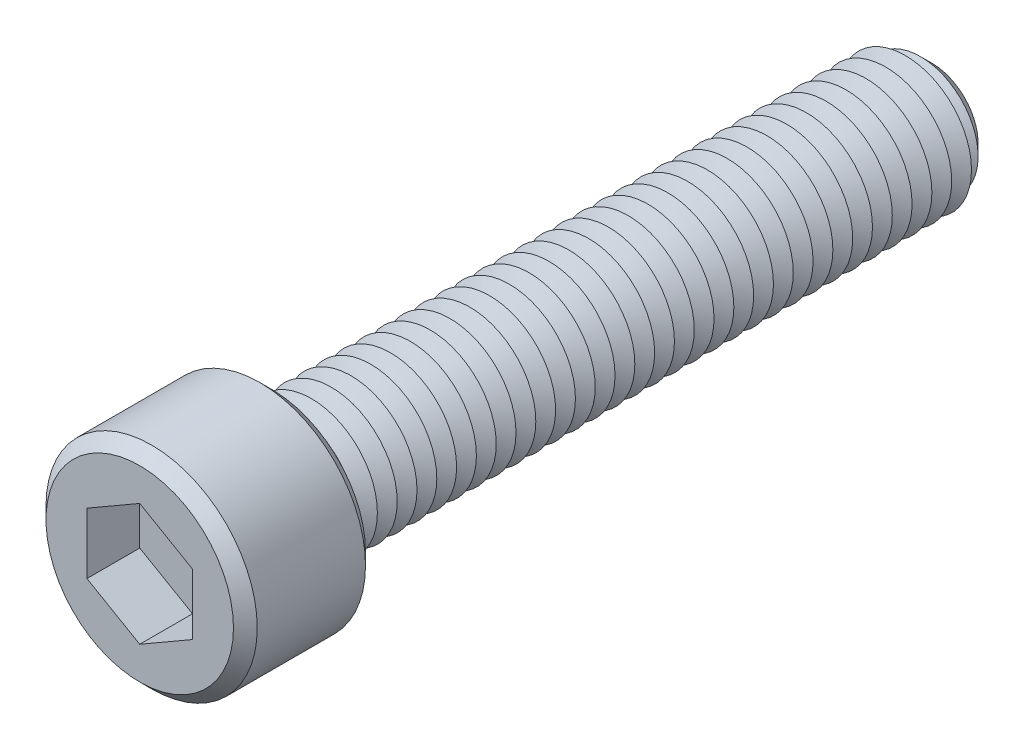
ISO-10303-21;
HEADER;
FILE_DESCRIPTION(('STEP AP214'),'2;1');
FILE_NAME('part.step','',(''),(''),'','','');
FILE_SCHEMA(('AUTOMOTIVE_DESIGN { 1 0 10303 214 1 1 1 1 }'));
ENDSEC;
DATA;
#1=APPLICATION_CONTEXT('core data for automotive mechanical design processes');
#2=APPLICATION_PROTOCOL_DEFINITION('international standard','automotive_design',2000,#1);
#3=PRODUCT_CONTEXT('',#1,'mechanical');
#4=PRODUCT('Part','Part','',(#3));
#5=PRODUCT_RELATED_PRODUCT_CATEGORY('part','',(#4));
#6=PRODUCT_DEFINITION_FORMATION('','',#4);
#7=PRODUCT_DEFINITION_CONTEXT('part definition',#1,'design');
#8=PRODUCT_DEFINITION('design','',#6,#7);
#9=PRODUCT_DEFINITION_SHAPE('','',#8);
#10=(LENGTH_UNIT() NAMED_UNIT(*) SI_UNIT(.MILLI.,.METRE.));
#11=(NAMED_UNIT(*) PLANE_ANGLE_UNIT() SI_UNIT($,.RADIAN.));
#12=(NAMED_UNIT(*) SI_UNIT($,.STERADIAN.) SOLID_ANGLE_UNIT());
#13=UNCERTAINTY_MEASURE_WITH_UNIT(LENGTH_MEASURE(1.E-05),#10,'distance_accuracy_value','');
#14=(GEOMETRIC_REPRESENTATION_CONTEXT(3) GLOBAL_UNCERTAINTY_ASSIGNED_CONTEXT((#13)) GLOBAL_UNIT_ASSIGNED_CONTEXT((#10,
#11,#12)) REPRESENTATION_CONTEXT('',''));
#15=CARTESIAN_POINT('',(0.,0.,0.));
#16=DIRECTION('',(0.,0.,1.));
#17=DIRECTION('',(1.,0.,0.));
#18=AXIS2_PLACEMENT_3D('',#15,#16,#17);
#19=CARTESIAN_POINT('',(0.,0.,10.));
#20=DIRECTION('',(0.,0.,-1.));
#21=DIRECTION('',(-1.,0.,0.));
#22=AXIS2_PLACEMENT_3D('',#19,#20,#21);
#23=CYLINDRICAL_SURFACE('',#22,8.);
#24=CARTESIAN_POINT('',(0.,0.,0.899999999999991));
#25=DIRECTION('',(0.,0.,1.));
#26=DIRECTION('',(1.,0.,0.));
#27=AXIS2_PLACEMENT_3D('',#24,#25,#26);
#28=CIRCLE('',#27,8.);
#29=CARTESIAN_POINT('',(8.,0.,0.899999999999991));
#30=VERTEX_POINT('',#29);
#31=EDGE_CURVE('E440',#30,#30,#28,.T.);
#32=ORIENTED_EDGE('',*,*,#31,.T.);
#33=EDGE_LOOP('',(#32));
#34=FACE_BOUND('',#33,.T.);
#35=CARTESIAN_POINT('',(0.,0.,9.1));
#36=DIRECTION('',(0.,0.,1.));
#37=DIRECTION('',(1.,0.,0.));
#38=AXIS2_PLACEMENT_3D('',#35,#36,#37);
#39=CIRCLE('',#38,8.);
#40=CARTESIAN_POINT('',(8.,0.,9.1));
#41=VERTEX_POINT('',#40);
#42=EDGE_CURVE('E433',#41,#41,#39,.F.);
#43=ORIENTED_EDGE('',*,*,#42,.T.);
#44=EDGE_LOOP('',(#43));
#45=FACE_BOUND('',#44,.T.);
#46=ADVANCED_FACE('F39',(#34,#45),#23,.T.);
#47=CARTESIAN_POINT('',(0.,0.,10.));
#48=DIRECTION('',(0.,0.,1.));
#49=DIRECTION('',(1.,0.,0.));
#50=AXIS2_PLACEMENT_3D('',#47,#48,#49);
#51=PLANE('',#50);
#52=CARTESIAN_POINT('',(0.,0.,10.));
#53=DIRECTION('',(0.,0.,1.));
#54=DIRECTION('',(1.,0.,0.));
#55=AXIS2_PLACEMENT_3D('',#52,#53,#54);
#56=CIRCLE('',#55,7.1);
#57=CARTESIAN_POINT('',(7.1,0.,10.));
#58=VERTEX_POINT('',#57);
#59=EDGE_CURVE('E11',#58,#58,#56,.T.);
#60=ORIENTED_EDGE('',*,*,#59,.T.);
#61=EDGE_LOOP('',(#60));
#62=FACE_BOUND('',#61,.T.);
#63=DIRECTION('',(-0.866025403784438,0.5,0.));
#64=VECTOR('',#63,1.);
#65=CARTESIAN_POINT('',(4.,2.3094010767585,10.));
#66=LINE('',#65,#64);
#67=CARTESIAN_POINT('',(4.,2.3094010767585,10.));
#68=VERTEX_POINT('',#67);
#69=CARTESIAN_POINT('',(0.,4.61880215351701,10.));
#70=VERTEX_POINT('',#69);
#71=EDGE_CURVE('E55',#68,#70,#66,.T.);
#72=ORIENTED_EDGE('',*,*,#71,.F.);
#73=DIRECTION('',(0.,1.,0.));
#74=VECTOR('',#73,1.);
#75=CARTESIAN_POINT('',(4.,-2.30940107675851,10.));
#76=LINE('',#75,#74);
#77=CARTESIAN_POINT('',(4.,-2.30940107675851,10.));
#78=VERTEX_POINT('',#77);
#79=EDGE_CURVE('E150',#78,#68,#76,.T.);
#80=ORIENTED_EDGE('',*,*,#79,.F.);
#81=DIRECTION('',(0.866025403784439,0.5,0.));
#82=VECTOR('',#81,1.);
#83=CARTESIAN_POINT('',(0.,-4.61880215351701,10.));
#84=LINE('',#83,#82);
#85=CARTESIAN_POINT('',(0.,-4.61880215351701,10.));
#86=VERTEX_POINT('',#85);
#87=EDGE_CURVE('E147',#86,#78,#84,.T.);
#88=ORIENTED_EDGE('',*,*,#87,.F.);
#89=DIRECTION('',(0.866025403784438,-0.5,0.));
#90=VECTOR('',#89,1.);
#91=CARTESIAN_POINT('',(-4.,-2.3094010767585,10.));
#92=LINE('',#91,#90);
#93=CARTESIAN_POINT('',(-4.,-2.3094010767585,10.));
#94=VERTEX_POINT('',#93);
#95=EDGE_CURVE('E103',#94,#86,#92,.T.);
#96=ORIENTED_EDGE('',*,*,#95,.F.);
#97=DIRECTION('',(0.,-1.,0.));
#98=VECTOR('',#97,1.);
#99=CARTESIAN_POINT('',(-4.,2.3094010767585,10.));
#100=LINE('',#99,#98);
#101=CARTESIAN_POINT('',(-4.,2.3094010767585,10.));
#102=VERTEX_POINT('',#101);
#103=EDGE_CURVE('E142',#102,#94,#100,.T.);
#104=ORIENTED_EDGE('',*,*,#103,.F.);
#105=DIRECTION('',(-0.866025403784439,-0.5,0.));
#106=VECTOR('',#105,1.);
#107=CARTESIAN_POINT('',(0.,4.61880215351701,10.));
#108=LINE('',#107,#106);
#109=EDGE_CURVE('E137',#70,#102,#108,.T.);
#110=ORIENTED_EDGE('',*,*,#109,.F.);
#111=EDGE_LOOP('',(#72,#80,#88,#96,#104,#110));
#112=FACE_BOUND('',#111,.T.);
#113=ADVANCED_FACE('F458',(#62,#112),#51,.T.);
#114=CARTESIAN_POINT('',(0.,0.,0.));
#115=DIRECTION('',(0.,0.,1.));
#116=DIRECTION('',(1.,0.,0.));
#117=AXIS2_PLACEMENT_3D('',#114,#115,#116);
#118=PLANE('',#117);
#119=CARTESIAN_POINT('',(0.,0.,0.));
#120=DIRECTION('',(0.,0.,1.));
#121=DIRECTION('',(1.,0.,0.));
#122=AXIS2_PLACEMENT_3D('',#119,#120,#121);
#123=CIRCLE('',#122,7.10000000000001);
#124=CARTESIAN_POINT('',(7.10000000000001,0.,0.));
#125=VERTEX_POINT('',#124);
#126=EDGE_CURVE('E48',#125,#125,#123,.F.);
#127=ORIENTED_EDGE('',*,*,#126,.T.);
#128=EDGE_LOOP('',(#127));
#129=FACE_BOUND('',#128,.T.);
#130=CARTESIAN_POINT('',(0.,0.,0.));
#131=DIRECTION('',(0.,0.,1.));
#132=DIRECTION('',(1.,0.,0.));
#133=AXIS2_PLACEMENT_3D('',#130,#131,#132);
#134=CIRCLE('',#133,5.);
#135=CARTESIAN_POINT('',(5.,0.,0.));
#136=VERTEX_POINT('',#135);
#137=EDGE_CURVE('E425',#136,#136,#134,.T.);
#138=ORIENTED_EDGE('',*,*,#137,.T.);
#139=EDGE_LOOP('',(#138));
#140=FACE_BOUND('',#139,.T.);
#141=ADVANCED_FACE('F447',(#129,#140),#118,.F.);
#142=CARTESIAN_POINT('',(0.,0.,0.));
#143=DIRECTION('',(0.,0.,1.));
#144=DIRECTION('',(1.,0.,0.));
#145=AXIS2_PLACEMENT_3D('',#142,#143,#144);
#146=CONICAL_SURFACE('',#145,5.,1.0471975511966);
#147=CARTESIAN_POINT('',(0.,0.,-0.750000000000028));
#148=DIRECTION('',(0.,0.,1.));
#149=DIRECTION('',(1.,0.,0.));
#150=AXIS2_PLACEMENT_3D('',#147,#148,#149);
#151=CIRCLE('',#150,3.70096189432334);
#152=CARTESIAN_POINT('',(3.70096189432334,0.,-0.750000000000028));
#153=VERTEX_POINT('',#152);
#154=EDGE_CURVE('E421',#153,#153,#151,.T.);
#155=ORIENTED_EDGE('',*,*,#154,.T.);
#156=EDGE_LOOP('',(#155));
#157=FACE_BOUND('',#156,.T.);
#158=ORIENTED_EDGE('',*,*,#137,.F.);
#159=EDGE_LOOP('',(#158));
#160=FACE_BOUND('',#159,.T.);
#161=ADVANCED_FACE('F772',(#157,#160),#146,.T.);
#162=CARTESIAN_POINT('',(0.,0.,-0.750000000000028));
#163=DIRECTION('',(0.,0.,-1.));
#164=DIRECTION('',(-1.,0.,0.));
#165=AXIS2_PLACEMENT_3D('',#162,#163,#164);
#166=CONICAL_SURFACE('',#165,3.70096189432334,1.0471975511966);
#167=CARTESIAN_POINT('',(0.,0.,-1.50000000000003));
#168=DIRECTION('',(0.,0.,1.));
#169=DIRECTION('',(1.,0.,0.));
#170=AXIS2_PLACEMENT_3D('',#167,#168,#169);
#171=CIRCLE('',#170,5.);
#172=CARTESIAN_POINT('',(5.,0.,-1.50000000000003));
#173=VERTEX_POINT('',#172);
#174=EDGE_CURVE('E417',#173,#173,#171,.T.);
#175=ORIENTED_EDGE('',*,*,#174,.T.);
#176=EDGE_LOOP('',(#175));
#177=FACE_BOUND('',#176,.T.);
#178=ORIENTED_EDGE('',*,*,#154,.F.);
#179=EDGE_LOOP('',(#178));
#180=FACE_BOUND('',#179,.T.);
#181=ADVANCED_FACE('F768',(#177,#180),#166,.T.);
#182=CARTESIAN_POINT('',(0.,0.,-1.50000000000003));
#183=DIRECTION('',(0.,0.,1.));
#184=DIRECTION('',(1.,0.,0.));
#185=AXIS2_PLACEMENT_3D('',#182,#183,#184);
#186=CONICAL_SURFACE('',#185,5.,1.0471975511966);
#187=CARTESIAN_POINT('',(0.,0.,-2.25000000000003));
#188=DIRECTION('',(0.,0.,1.));
#189=DIRECTION('',(1.,0.,0.));
#190=AXIS2_PLACEMENT_3D('',#187,#188,#189);
#191=CIRCLE('',#190,3.70096189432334);
#192=CARTESIAN_POINT('',(3.70096189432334,0.,-2.25000000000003));
#193=VERTEX_POINT('',#192);
#194=EDGE_CURVE('E413',#193,#193,#191,.T.);
#195=ORIENTED_EDGE('',*,*,#194,.T.);
#196=EDGE_LOOP('',(#195));
#197=FACE_BOUND('',#196,.T.);
#198=ORIENTED_EDGE('',*,*,#174,.F.);
#199=EDGE_LOOP('',(#198));
#200=FACE_BOUND('',#199,.T.);
#201=ADVANCED_FACE('F764',(#197,#200),#186,.T.);
#202=CARTESIAN_POINT('',(0.,0.,-2.25000000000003));
#203=DIRECTION('',(0.,0.,-1.));
#204=DIRECTION('',(-1.,0.,0.));
#205=AXIS2_PLACEMENT_3D('',#202,#203,#204);
#206=CONICAL_SURFACE('',#205,3.70096189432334,1.0471975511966);
#207=CARTESIAN_POINT('',(0.,0.,-3.00000000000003));
#208=DIRECTION('',(0.,0.,1.));
#209=DIRECTION('',(1.,0.,0.));
#210=AXIS2_PLACEMENT_3D('',#207,#208,#209);
#211=CIRCLE('',#210,5.);
#212=CARTESIAN_POINT('',(5.,0.,-3.00000000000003));
#213=VERTEX_POINT('',#212);
#214=EDGE_CURVE('E409',#213,#213,#211,.T.);
#215=ORIENTED_EDGE('',*,*,#214,.T.);
#216=EDGE_LOOP('',(#215));
#217=FACE_BOUND('',#216,.T.);
#218=ORIENTED_EDGE('',*,*,#194,.F.);
#219=EDGE_LOOP('',(#218));
#220=FACE_BOUND('',#219,.T.);
#221=ADVANCED_FACE('F760',(#217,#220),#206,.T.);
#222=CARTESIAN_POINT('',(0.,0.,-3.00000000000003));
#223=DIRECTION('',(0.,0.,1.));
#224=DIRECTION('',(1.,0.,0.));
#225=AXIS2_PLACEMENT_3D('',#222,#223,#224);
#226=CONICAL_SURFACE('',#225,5.,1.0471975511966);
#227=CARTESIAN_POINT('',(0.,0.,-3.75000000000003));
#228=DIRECTION('',(0.,0.,1.));
#229=DIRECTION('',(1.,0.,0.));
#230=AXIS2_PLACEMENT_3D('',#227,#228,#229);
#231=CIRCLE('',#230,3.70096189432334);
#232=CARTESIAN_POINT('',(3.70096189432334,0.,-3.75000000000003));
#233=VERTEX_POINT('',#232);
#234=EDGE_CURVE('E405',#233,#233,#231,.T.);
#235=ORIENTED_EDGE('',*,*,#234,.T.);
#236=EDGE_LOOP('',(#235));
#237=FACE_BOUND('',#236,.T.);
#238=ORIENTED_EDGE('',*,*,#214,.F.);
#239=EDGE_LOOP('',(#238));
#240=FACE_BOUND('',#239,.T.);
#241=ADVANCED_FACE('F756',(#237,#240),#226,.T.);
#242=CARTESIAN_POINT('',(0.,0.,-3.75000000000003));
#243=DIRECTION('',(0.,0.,-1.));
#244=DIRECTION('',(-1.,0.,0.));
#245=AXIS2_PLACEMENT_3D('',#242,#243,#244);
#246=CONICAL_SURFACE('',#245,3.70096189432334,1.0471975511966);
#247=CARTESIAN_POINT('',(0.,0.,-4.50000000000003));
#248=DIRECTION('',(0.,0.,1.));
#249=DIRECTION('',(1.,0.,0.));
#250=AXIS2_PLACEMENT_3D('',#247,#248,#249);
#251=CIRCLE('',#250,5.);
#252=CARTESIAN_POINT('',(5.,0.,-4.50000000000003));
#253=VERTEX_POINT('',#252);
#254=EDGE_CURVE('E401',#253,#253,#251,.T.);
#255=ORIENTED_EDGE('',*,*,#254,.T.);
#256=EDGE_LOOP('',(#255));
#257=FACE_BOUND('',#256,.T.);
#258=ORIENTED_EDGE('',*,*,#234,.F.);
#259=EDGE_LOOP('',(#258));
#260=FACE_BOUND('',#259,.T.);
#261=ADVANCED_FACE('F752',(#257,#260),#246,.T.);
#262=CARTESIAN_POINT('',(0.,0.,-4.50000000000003));
#263=DIRECTION('',(0.,0.,1.));
#264=DIRECTION('',(1.,0.,0.));
#265=AXIS2_PLACEMENT_3D('',#262,#263,#264);
#266=CONICAL_SURFACE('',#265,5.,1.0471975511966);
#267=CARTESIAN_POINT('',(0.,0.,-5.25000000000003));
#268=DIRECTION('',(0.,0.,1.));
#269=DIRECTION('',(1.,0.,0.));
#270=AXIS2_PLACEMENT_3D('',#267,#268,#269);
#271=CIRCLE('',#270,3.70096189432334);
#272=CARTESIAN_POINT('',(3.70096189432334,0.,-5.25000000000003));
#273=VERTEX_POINT('',#272);
#274=EDGE_CURVE('E397',#273,#273,#271,.T.);
#275=ORIENTED_EDGE('',*,*,#274,.T.);
#276=EDGE_LOOP('',(#275));
#277=FACE_BOUND('',#276,.T.);
#278=ORIENTED_EDGE('',*,*,#254,.F.);
#279=EDGE_LOOP('',(#278));
#280=FACE_BOUND('',#279,.T.);
#281=ADVANCED_FACE('F748',(#277,#280),#266,.T.);
#282=CARTESIAN_POINT('',(0.,0.,-5.25000000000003));
#283=DIRECTION('',(0.,0.,-1.));
#284=DIRECTION('',(-1.,0.,0.));
#285=AXIS2_PLACEMENT_3D('',#282,#283,#284);
#286=CONICAL_SURFACE('',#285,3.70096189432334,1.0471975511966);
#287=CARTESIAN_POINT('',(0.,0.,-6.00000000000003));
#288=DIRECTION('',(0.,0.,1.));
#289=DIRECTION('',(1.,0.,0.));
#290=AXIS2_PLACEMENT_3D('',#287,#288,#289);
#291=CIRCLE('',#290,5.);
#292=CARTESIAN_POINT('',(5.,0.,-6.00000000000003));
#293=VERTEX_POINT('',#292);
#294=EDGE_CURVE('E393',#293,#293,#291,.T.);
#295=ORIENTED_EDGE('',*,*,#294,.T.);
#296=EDGE_LOOP('',(#295));
#297=FACE_BOUND('',#296,.T.);
#298=ORIENTED_EDGE('',*,*,#274,.F.);
#299=EDGE_LOOP('',(#298));
#300=FACE_BOUND('',#299,.T.);
#301=ADVANCED_FACE('F744',(#297,#300),#286,.T.);
#302=CARTESIAN_POINT('',(0.,0.,-6.00000000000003));
#303=DIRECTION('',(0.,0.,1.));
#304=DIRECTION('',(1.,0.,0.));
#305=AXIS2_PLACEMENT_3D('',#302,#303,#304);
#306=CONICAL_SURFACE('',#305,5.,1.0471975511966);
#307=CARTESIAN_POINT('',(0.,0.,-6.75000000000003));
#308=DIRECTION('',(0.,0.,1.));
#309=DIRECTION('',(1.,0.,0.));
#310=AXIS2_PLACEMENT_3D('',#307,#308,#309);
#311=CIRCLE('',#310,3.70096189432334);
#312=CARTESIAN_POINT('',(3.70096189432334,0.,-6.75000000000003));
#313=VERTEX_POINT('',#312);
#314=EDGE_CURVE('E389',#313,#313,#311,.T.);
#315=ORIENTED_EDGE('',*,*,#314,.T.);
#316=EDGE_LOOP('',(#315));
#317=FACE_BOUND('',#316,.T.);
#318=ORIENTED_EDGE('',*,*,#294,.F.);
#319=EDGE_LOOP('',(#318));
#320=FACE_BOUND('',#319,.T.);
#321=ADVANCED_FACE('F740',(#317,#320),#306,.T.);
#322=CARTESIAN_POINT('',(0.,0.,-6.75000000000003));
#323=DIRECTION('',(0.,0.,-1.));
#324=DIRECTION('',(-1.,0.,0.));
#325=AXIS2_PLACEMENT_3D('',#322,#323,#324);
#326=CONICAL_SURFACE('',#325,3.70096189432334,1.0471975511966);
#327=CARTESIAN_POINT('',(0.,0.,-7.50000000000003));
#328=DIRECTION('',(0.,0.,1.));
#329=DIRECTION('',(1.,0.,0.));
#330=AXIS2_PLACEMENT_3D('',#327,#328,#329);
#331=CIRCLE('',#330,5.);
#332=CARTESIAN_POINT('',(5.,0.,-7.50000000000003));
#333=VERTEX_POINT('',#332);
#334=EDGE_CURVE('E385',#333,#333,#331,.T.);
#335=ORIENTED_EDGE('',*,*,#334,.T.);
#336=EDGE_LOOP('',(#335));
#337=FACE_BOUND('',#336,.T.);
#338=ORIENTED_EDGE('',*,*,#314,.F.);
#339=EDGE_LOOP('',(#338));
#340=FACE_BOUND('',#339,.T.);
#341=ADVANCED_FACE('F736',(#337,#340),#326,.T.);
#342=CARTESIAN_POINT('',(0.,0.,-7.50000000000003));
#343=DIRECTION('',(0.,0.,1.));
#344=DIRECTION('',(1.,0.,0.));
#345=AXIS2_PLACEMENT_3D('',#342,#343,#344);
#346=CONICAL_SURFACE('',#345,5.,1.0471975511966);
#347=CARTESIAN_POINT('',(0.,0.,-8.25000000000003));
#348=DIRECTION('',(0.,0.,1.));
#349=DIRECTION('',(1.,0.,0.));
#350=AXIS2_PLACEMENT_3D('',#347,#348,#349);
#351=CIRCLE('',#350,3.70096189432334);
#352=CARTESIAN_POINT('',(3.70096189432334,0.,-8.25000000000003));
#353=VERTEX_POINT('',#352);
#354=EDGE_CURVE('E381',#353,#353,#351,.T.);
#355=ORIENTED_EDGE('',*,*,#354,.T.);
#356=EDGE_LOOP('',(#355));
#357=FACE_BOUND('',#356,.T.);
#358=ORIENTED_EDGE('',*,*,#334,.F.);
#359=EDGE_LOOP('',(#358));
#360=FACE_BOUND('',#359,.T.);
#361=ADVANCED_FACE('F732',(#357,#360),#346,.T.);
#362=CARTESIAN_POINT('',(0.,0.,-8.25000000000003));
#363=DIRECTION('',(0.,0.,-1.));
#364=DIRECTION('',(-1.,0.,0.));
#365=AXIS2_PLACEMENT_3D('',#362,#363,#364);
#366=CONICAL_SURFACE('',#365,3.70096189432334,1.0471975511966);
#367=CARTESIAN_POINT('',(0.,0.,-9.00000000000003));
#368=DIRECTION('',(0.,0.,1.));
#369=DIRECTION('',(1.,0.,0.));
#370=AXIS2_PLACEMENT_3D('',#367,#368,#369);
#371=CIRCLE('',#370,5.);
#372=CARTESIAN_POINT('',(5.,0.,-9.00000000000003));
#373=VERTEX_POINT('',#372);
#374=EDGE_CURVE('E377',#373,#373,#371,.T.);
#375=ORIENTED_EDGE('',*,*,#374,.T.);
#376=EDGE_LOOP('',(#375));
#377=FACE_BOUND('',#376,.T.);
#378=ORIENTED_EDGE('',*,*,#354,.F.);
#379=EDGE_LOOP('',(#378));
#380=FACE_BOUND('',#379,.T.);
#381=ADVANCED_FACE('F728',(#377,#380),#366,.T.);
#382=CARTESIAN_POINT('',(0.,0.,-9.00000000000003));
#383=DIRECTION('',(0.,0.,1.));
#384=DIRECTION('',(1.,0.,0.));
#385=AXIS2_PLACEMENT_3D('',#382,#383,#384);
#386=CONICAL_SURFACE('',#385,5.,1.0471975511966);
#387=CARTESIAN_POINT('',(0.,0.,-9.75000000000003));
#388=DIRECTION('',(0.,0.,1.));
#389=DIRECTION('',(1.,0.,0.));
#390=AXIS2_PLACEMENT_3D('',#387,#388,#389);
#391=CIRCLE('',#390,3.70096189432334);
#392=CARTESIAN_POINT('',(3.70096189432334,0.,-9.75000000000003));
#393=VERTEX_POINT('',#392);
#394=EDGE_CURVE('E373',#393,#393,#391,.T.);
#395=ORIENTED_EDGE('',*,*,#394,.T.);
#396=EDGE_LOOP('',(#395));
#397=FACE_BOUND('',#396,.T.);
#398=ORIENTED_EDGE('',*,*,#374,.F.);
#399=EDGE_LOOP('',(#398));
#400=FACE_BOUND('',#399,.T.);
#401=ADVANCED_FACE('F724',(#397,#400),#386,.T.);
#402=CARTESIAN_POINT('',(0.,0.,-9.75000000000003));
#403=DIRECTION('',(0.,0.,-1.));
#404=DIRECTION('',(-1.,0.,0.));
#405=AXIS2_PLACEMENT_3D('',#402,#403,#404);
#406=CONICAL_SURFACE('',#405,3.70096189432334,1.0471975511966);
#407=CARTESIAN_POINT('',(0.,0.,-10.5));
#408=DIRECTION('',(0.,0.,1.));
#409=DIRECTION('',(1.,0.,0.));
#410=AXIS2_PLACEMENT_3D('',#407,#408,#409);
#411=CIRCLE('',#410,5.);
#412=CARTESIAN_POINT('',(5.,0.,-10.5));
#413=VERTEX_POINT('',#412);
#414=EDGE_CURVE('E369',#413,#413,#411,.T.);
#415=ORIENTED_EDGE('',*,*,#414,.T.);
#416=EDGE_LOOP('',(#415));
#417=FACE_BOUND('',#416,.T.);
#418=ORIENTED_EDGE('',*,*,#394,.F.);
#419=EDGE_LOOP('',(#418));
#420=FACE_BOUND('',#419,.T.);
#421=ADVANCED_FACE('F720',(#417,#420),#406,.T.);
#422=CARTESIAN_POINT('',(0.,0.,-10.5));
#423=DIRECTION('',(0.,0.,1.));
#424=DIRECTION('',(1.,0.,0.));
#425=AXIS2_PLACEMENT_3D('',#422,#423,#424);
#426=CONICAL_SURFACE('',#425,5.,1.0471975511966);
#427=CARTESIAN_POINT('',(0.,0.,-11.25));
#428=DIRECTION('',(0.,0.,1.));
#429=DIRECTION('',(1.,0.,0.));
#430=AXIS2_PLACEMENT_3D('',#427,#428,#429);
#431=CIRCLE('',#430,3.70096189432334);
#432=CARTESIAN_POINT('',(3.70096189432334,0.,-11.25));
#433=VERTEX_POINT('',#432);
#434=EDGE_CURVE('E365',#433,#433,#431,.T.);
#435=ORIENTED_EDGE('',*,*,#434,.T.);
#436=EDGE_LOOP('',(#435));
#437=FACE_BOUND('',#436,.T.);
#438=ORIENTED_EDGE('',*,*,#414,.F.);
#439=EDGE_LOOP('',(#438));
#440=FACE_BOUND('',#439,.T.);
#441=ADVANCED_FACE('F716',(#437,#440),#426,.T.);
#442=CARTESIAN_POINT('',(0.,0.,-11.25));
#443=DIRECTION('',(0.,0.,-1.));
#444=DIRECTION('',(-1.,0.,0.));
#445=AXIS2_PLACEMENT_3D('',#442,#443,#444);
#446=CONICAL_SURFACE('',#445,3.70096189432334,1.0471975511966);
#447=CARTESIAN_POINT('',(0.,0.,-12.));
#448=DIRECTION('',(0.,0.,1.));
#449=DIRECTION('',(1.,0.,0.));
#450=AXIS2_PLACEMENT_3D('',#447,#448,#449);
#451=CIRCLE('',#450,5.);
#452=CARTESIAN_POINT('',(5.,0.,-12.));
#453=VERTEX_POINT('',#452);
#454=EDGE_CURVE('E361',#453,#453,#451,.T.);
#455=ORIENTED_EDGE('',*,*,#454,.T.);
#456=EDGE_LOOP('',(#455));
#457=FACE_BOUND('',#456,.T.);
#458=ORIENTED_EDGE('',*,*,#434,.F.);
#459=EDGE_LOOP('',(#458));
#460=FACE_BOUND('',#459,.T.);
#461=ADVANCED_FACE('F712',(#457,#460),#446,.T.);
#462=CARTESIAN_POINT('',(0.,0.,-12.));
#463=DIRECTION('',(0.,0.,1.));
#464=DIRECTION('',(1.,0.,0.));
#465=AXIS2_PLACEMENT_3D('',#462,#463,#464);
#466=CONICAL_SURFACE('',#465,5.,1.0471975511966);
#467=CARTESIAN_POINT('',(0.,0.,-12.75));
#468=DIRECTION('',(0.,0.,1.));
#469=DIRECTION('',(1.,0.,0.));
#470=AXIS2_PLACEMENT_3D('',#467,#468,#469);
#471=CIRCLE('',#470,3.70096189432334);
#472=CARTESIAN_POINT('',(3.70096189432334,0.,-12.75));
#473=VERTEX_POINT('',#472);
#474=EDGE_CURVE('E357',#473,#473,#471,.T.);
#475=ORIENTED_EDGE('',*,*,#474,.T.);
#476=EDGE_LOOP('',(#475));
#477=FACE_BOUND('',#476,.T.);
#478=ORIENTED_EDGE('',*,*,#454,.F.);
#479=EDGE_LOOP('',(#478));
#480=FACE_BOUND('',#479,.T.);
#481=ADVANCED_FACE('F708',(#477,#480),#466,.T.);
#482=CARTESIAN_POINT('',(0.,0.,-12.75));
#483=DIRECTION('',(0.,0.,-1.));
#484=DIRECTION('',(-1.,0.,0.));
#485=AXIS2_PLACEMENT_3D('',#482,#483,#484);
#486=CONICAL_SURFACE('',#485,3.70096189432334,1.0471975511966);
#487=CARTESIAN_POINT('',(0.,0.,-13.5));
#488=DIRECTION('',(0.,0.,1.));
#489=DIRECTION('',(1.,0.,0.));
#490=AXIS2_PLACEMENT_3D('',#487,#488,#489);
#491=CIRCLE('',#490,5.);
#492=CARTESIAN_POINT('',(5.,0.,-13.5));
#493=VERTEX_POINT('',#492);
#494=EDGE_CURVE('E353',#493,#493,#491,.T.);
#495=ORIENTED_EDGE('',*,*,#494,.T.);
#496=EDGE_LOOP('',(#495));
#497=FACE_BOUND('',#496,.T.);
#498=ORIENTED_EDGE('',*,*,#474,.F.);
#499=EDGE_LOOP('',(#498));
#500=FACE_BOUND('',#499,.T.);
#501=ADVANCED_FACE('F704',(#497,#500),#486,.T.);
#502=CARTESIAN_POINT('',(0.,0.,-13.5));
#503=DIRECTION('',(0.,0.,1.));
#504=DIRECTION('',(1.,0.,0.));
#505=AXIS2_PLACEMENT_3D('',#502,#503,#504);
#506=CONICAL_SURFACE('',#505,5.,1.0471975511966);
#507=CARTESIAN_POINT('',(0.,0.,-14.25));
#508=DIRECTION('',(0.,0.,1.));
#509=DIRECTION('',(1.,0.,0.));
#510=AXIS2_PLACEMENT_3D('',#507,#508,#509);
#511=CIRCLE('',#510,3.70096189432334);
#512=CARTESIAN_POINT('',(3.70096189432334,0.,-14.25));
#513=VERTEX_POINT('',#512);
#514=EDGE_CURVE('E349',#513,#513,#511,.T.);
#515=ORIENTED_EDGE('',*,*,#514,.T.);
#516=EDGE_LOOP('',(#515));
#517=FACE_BOUND('',#516,.T.);
#518=ORIENTED_EDGE('',*,*,#494,.F.);
#519=EDGE_LOOP('',(#518));
#520=FACE_BOUND('',#519,.T.);
#521=ADVANCED_FACE('F700',(#517,#520),#506,.T.);
#522=CARTESIAN_POINT('',(0.,0.,-14.25));
#523=DIRECTION('',(0.,0.,-1.));
#524=DIRECTION('',(-1.,0.,0.));
#525=AXIS2_PLACEMENT_3D('',#522,#523,#524);
#526=CONICAL_SURFACE('',#525,3.70096189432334,1.0471975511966);
#527=CARTESIAN_POINT('',(0.,0.,-15.));
#528=DIRECTION('',(0.,0.,1.));
#529=DIRECTION('',(1.,0.,0.));
#530=AXIS2_PLACEMENT_3D('',#527,#528,#529);
#531=CIRCLE('',#530,5.);
#532=CARTESIAN_POINT('',(5.,0.,-15.));
#533=VERTEX_POINT('',#532);
#534=EDGE_CURVE('E345',#533,#533,#531,.T.);
#535=ORIENTED_EDGE('',*,*,#534,.T.);
#536=EDGE_LOOP('',(#535));
#537=FACE_BOUND('',#536,.T.);
#538=ORIENTED_EDGE('',*,*,#514,.F.);
#539=EDGE_LOOP('',(#538));
#540=FACE_BOUND('',#539,.T.);
#541=ADVANCED_FACE('F696',(#537,#540),#526,.T.);
#542=CARTESIAN_POINT('',(0.,0.,-15.));
#543=DIRECTION('',(0.,0.,1.));
#544=DIRECTION('',(1.,0.,0.));
#545=AXIS2_PLACEMENT_3D('',#542,#543,#544);
#546=CONICAL_SURFACE('',#545,5.,1.0471975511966);
#547=CARTESIAN_POINT('',(0.,0.,-15.75));
#548=DIRECTION('',(0.,0.,1.));
#549=DIRECTION('',(1.,0.,0.));
#550=AXIS2_PLACEMENT_3D('',#547,#548,#549);
#551=CIRCLE('',#550,3.70096189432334);
#552=CARTESIAN_POINT('',(3.70096189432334,0.,-15.75));
#553=VERTEX_POINT('',#552);
#554=EDGE_CURVE('E341',#553,#553,#551,.T.);
#555=ORIENTED_EDGE('',*,*,#554,.T.);
#556=EDGE_LOOP('',(#555));
#557=FACE_BOUND('',#556,.T.);
#558=ORIENTED_EDGE('',*,*,#534,.F.);
#559=EDGE_LOOP('',(#558));
#560=FACE_BOUND('',#559,.T.);
#561=ADVANCED_FACE('F692',(#557,#560),#546,.T.);
#562=CARTESIAN_POINT('',(0.,0.,-15.75));
#563=DIRECTION('',(0.,0.,-1.));
#564=DIRECTION('',(-1.,0.,0.));
#565=AXIS2_PLACEMENT_3D('',#562,#563,#564);
#566=CONICAL_SURFACE('',#565,3.70096189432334,1.0471975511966);
#567=CARTESIAN_POINT('',(0.,0.,-16.5));
#568=DIRECTION('',(0.,0.,1.));
#569=DIRECTION('',(1.,0.,0.));
#570=AXIS2_PLACEMENT_3D('',#567,#568,#569);
#571=CIRCLE('',#570,5.);
#572=CARTESIAN_POINT('',(5.,0.,-16.5));
#573=VERTEX_POINT('',#572);
#574=EDGE_CURVE('E337',#573,#573,#571,.T.);
#575=ORIENTED_EDGE('',*,*,#574,.T.);
#576=EDGE_LOOP('',(#575));
#577=FACE_BOUND('',#576,.T.);
#578=ORIENTED_EDGE('',*,*,#554,.F.);
#579=EDGE_LOOP('',(#578));
#580=FACE_BOUND('',#579,.T.);
#581=ADVANCED_FACE('F688',(#577,#580),#566,.T.);
#582=CARTESIAN_POINT('',(0.,0.,-16.5));
#583=DIRECTION('',(0.,0.,1.));
#584=DIRECTION('',(1.,0.,0.));
#585=AXIS2_PLACEMENT_3D('',#582,#583,#584);
#586=CONICAL_SURFACE('',#585,5.,1.0471975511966);
#587=CARTESIAN_POINT('',(0.,0.,-17.25));
#588=DIRECTION('',(0.,0.,1.));
#589=DIRECTION('',(1.,0.,0.));
#590=AXIS2_PLACEMENT_3D('',#587,#588,#589);
#591=CIRCLE('',#590,3.70096189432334);
#592=CARTESIAN_POINT('',(3.70096189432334,0.,-17.25));
#593=VERTEX_POINT('',#592);
#594=EDGE_CURVE('E333',#593,#593,#591,.T.);
#595=ORIENTED_EDGE('',*,*,#594,.T.);
#596=EDGE_LOOP('',(#595));
#597=FACE_BOUND('',#596,.T.);
#598=ORIENTED_EDGE('',*,*,#574,.F.);
#599=EDGE_LOOP('',(#598));
#600=FACE_BOUND('',#599,.T.);
#601=ADVANCED_FACE('F684',(#597,#600),#586,.T.);
#602=CARTESIAN_POINT('',(0.,0.,-17.25));
#603=DIRECTION('',(0.,0.,-1.));
#604=DIRECTION('',(-1.,0.,0.));
#605=AXIS2_PLACEMENT_3D('',#602,#603,#604);
#606=CONICAL_SURFACE('',#605,3.70096189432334,1.0471975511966);
#607=CARTESIAN_POINT('',(0.,0.,-18.));
#608=DIRECTION('',(0.,0.,1.));
#609=DIRECTION('',(1.,0.,0.));
#610=AXIS2_PLACEMENT_3D('',#607,#608,#609);
#611=CIRCLE('',#610,5.);
#612=CARTESIAN_POINT('',(5.,0.,-18.));
#613=VERTEX_POINT('',#612);
#614=EDGE_CURVE('E329',#613,#613,#611,.T.);
#615=ORIENTED_EDGE('',*,*,#614,.T.);
#616=EDGE_LOOP('',(#615));
#617=FACE_BOUND('',#616,.T.);
#618=ORIENTED_EDGE('',*,*,#594,.F.);
#619=EDGE_LOOP('',(#618));
#620=FACE_BOUND('',#619,.T.);
#621=ADVANCED_FACE('F680',(#617,#620),#606,.T.);
#622=CARTESIAN_POINT('',(0.,0.,-18.));
#623=DIRECTION('',(0.,0.,1.));
#624=DIRECTION('',(1.,0.,0.));
#625=AXIS2_PLACEMENT_3D('',#622,#623,#624);
#626=CONICAL_SURFACE('',#625,5.,1.0471975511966);
#627=CARTESIAN_POINT('',(0.,0.,-18.75));
#628=DIRECTION('',(0.,0.,1.));
#629=DIRECTION('',(1.,0.,0.));
#630=AXIS2_PLACEMENT_3D('',#627,#628,#629);
#631=CIRCLE('',#630,3.70096189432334);
#632=CARTESIAN_POINT('',(3.70096189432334,0.,-18.75));
#633=VERTEX_POINT('',#632);
#634=EDGE_CURVE('E325',#633,#633,#631,.T.);
#635=ORIENTED_EDGE('',*,*,#634,.T.);
#636=EDGE_LOOP('',(#635));
#637=FACE_BOUND('',#636,.T.);
#638=ORIENTED_EDGE('',*,*,#614,.F.);
#639=EDGE_LOOP('',(#638));
#640=FACE_BOUND('',#639,.T.);
#641=ADVANCED_FACE('F676',(#637,#640),#626,.T.);
#642=CARTESIAN_POINT('',(0.,0.,-18.75));
#643=DIRECTION('',(0.,0.,-1.));
#644=DIRECTION('',(-1.,0.,0.));
#645=AXIS2_PLACEMENT_3D('',#642,#643,#644);
#646=CONICAL_SURFACE('',#645,3.70096189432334,1.0471975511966);
#647=CARTESIAN_POINT('',(0.,0.,-19.5));
#648=DIRECTION('',(0.,0.,1.));
#649=DIRECTION('',(1.,0.,0.));
#650=AXIS2_PLACEMENT_3D('',#647,#648,#649);
#651=CIRCLE('',#650,5.);
#652=CARTESIAN_POINT('',(5.,0.,-19.5));
#653=VERTEX_POINT('',#652);
#654=EDGE_CURVE('E321',#653,#653,#651,.T.);
#655=ORIENTED_EDGE('',*,*,#654,.T.);
#656=EDGE_LOOP('',(#655));
#657=FACE_BOUND('',#656,.T.);
#658=ORIENTED_EDGE('',*,*,#634,.F.);
#659=EDGE_LOOP('',(#658));
#660=FACE_BOUND('',#659,.T.);
#661=ADVANCED_FACE('F672',(#657,#660),#646,.T.);
#662=CARTESIAN_POINT('',(0.,0.,-19.5));
#663=DIRECTION('',(0.,0.,1.));
#664=DIRECTION('',(1.,0.,0.));
#665=AXIS2_PLACEMENT_3D('',#662,#663,#664);
#666=CONICAL_SURFACE('',#665,5.,1.0471975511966);
#667=CARTESIAN_POINT('',(0.,0.,-20.25));
#668=DIRECTION('',(0.,0.,1.));
#669=DIRECTION('',(1.,0.,0.));
#670=AXIS2_PLACEMENT_3D('',#667,#668,#669);
#671=CIRCLE('',#670,3.70096189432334);
#672=CARTESIAN_POINT('',(3.70096189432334,0.,-20.25));
#673=VERTEX_POINT('',#672);
#674=EDGE_CURVE('E317',#673,#673,#671,.T.);
#675=ORIENTED_EDGE('',*,*,#674,.T.);
#676=EDGE_LOOP('',(#675));
#677=FACE_BOUND('',#676,.T.);
#678=ORIENTED_EDGE('',*,*,#654,.F.);
#679=EDGE_LOOP('',(#678));
#680=FACE_BOUND('',#679,.T.);
#681=ADVANCED_FACE('F668',(#677,#680),#666,.T.);
#682=CARTESIAN_POINT('',(0.,0.,-20.25));
#683=DIRECTION('',(0.,0.,-1.));
#684=DIRECTION('',(-1.,0.,0.));
#685=AXIS2_PLACEMENT_3D('',#682,#683,#684);
#686=CONICAL_SURFACE('',#685,3.70096189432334,1.0471975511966);
#687=CARTESIAN_POINT('',(0.,0.,-21.));
#688=DIRECTION('',(0.,0.,1.));
#689=DIRECTION('',(1.,0.,0.));
#690=AXIS2_PLACEMENT_3D('',#687,#688,#689);
#691=CIRCLE('',#690,5.);
#692=CARTESIAN_POINT('',(5.,0.,-21.));
#693=VERTEX_POINT('',#692);
#694=EDGE_CURVE('E313',#693,#693,#691,.T.);
#695=ORIENTED_EDGE('',*,*,#694,.T.);
#696=EDGE_LOOP('',(#695));
#697=FACE_BOUND('',#696,.T.);
#698=ORIENTED_EDGE('',*,*,#674,.F.);
#699=EDGE_LOOP('',(#698));
#700=FACE_BOUND('',#699,.T.);
#701=ADVANCED_FACE('F664',(#697,#700),#686,.T.);
#702=CARTESIAN_POINT('',(0.,0.,-21.));
#703=DIRECTION('',(0.,0.,1.));
#704=DIRECTION('',(1.,0.,0.));
#705=AXIS2_PLACEMENT_3D('',#702,#703,#704);
#706=CONICAL_SURFACE('',#705,5.,1.0471975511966);
#707=CARTESIAN_POINT('',(0.,0.,-21.75));
#708=DIRECTION('',(0.,0.,1.));
#709=DIRECTION('',(1.,0.,0.));
#710=AXIS2_PLACEMENT_3D('',#707,#708,#709);
#711=CIRCLE('',#710,3.70096189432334);
#712=CARTESIAN_POINT('',(3.70096189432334,0.,-21.75));
#713=VERTEX_POINT('',#712);
#714=EDGE_CURVE('E309',#713,#713,#711,.T.);
#715=ORIENTED_EDGE('',*,*,#714,.T.);
#716=EDGE_LOOP('',(#715));
#717=FACE_BOUND('',#716,.T.);
#718=ORIENTED_EDGE('',*,*,#694,.F.);
#719=EDGE_LOOP('',(#718));
#720=FACE_BOUND('',#719,.T.);
#721=ADVANCED_FACE('F660',(#717,#720),#706,.T.);
#722=CARTESIAN_POINT('',(0.,0.,-21.75));
#723=DIRECTION('',(0.,0.,-1.));
#724=DIRECTION('',(-1.,0.,0.));
#725=AXIS2_PLACEMENT_3D('',#722,#723,#724);
#726=CONICAL_SURFACE('',#725,3.70096189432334,1.0471975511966);
#727=CARTESIAN_POINT('',(0.,0.,-22.5));
#728=DIRECTION('',(0.,0.,1.));
#729=DIRECTION('',(1.,0.,0.));
#730=AXIS2_PLACEMENT_3D('',#727,#728,#729);
#731=CIRCLE('',#730,5.);
#732=CARTESIAN_POINT('',(5.,0.,-22.5));
#733=VERTEX_POINT('',#732);
#734=EDGE_CURVE('E305',#733,#733,#731,.T.);
#735=ORIENTED_EDGE('',*,*,#734,.T.);
#736=EDGE_LOOP('',(#735));
#737=FACE_BOUND('',#736,.T.);
#738=ORIENTED_EDGE('',*,*,#714,.F.);
#739=EDGE_LOOP('',(#738));
#740=FACE_BOUND('',#739,.T.);
#741=ADVANCED_FACE('F656',(#737,#740),#726,.T.);
#742=CARTESIAN_POINT('',(0.,0.,-22.5));
#743=DIRECTION('',(0.,0.,1.));
#744=DIRECTION('',(1.,0.,0.));
#745=AXIS2_PLACEMENT_3D('',#742,#743,#744);
#746=CONICAL_SURFACE('',#745,5.,1.0471975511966);
#747=CARTESIAN_POINT('',(0.,0.,-23.25));
#748=DIRECTION('',(0.,0.,1.));
#749=DIRECTION('',(1.,0.,0.));
#750=AXIS2_PLACEMENT_3D('',#747,#748,#749);
#751=CIRCLE('',#750,3.70096189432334);
#752=CARTESIAN_POINT('',(3.70096189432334,0.,-23.25));
#753=VERTEX_POINT('',#752);
#754=EDGE_CURVE('E301',#753,#753,#751,.T.);
#755=ORIENTED_EDGE('',*,*,#754,.T.);
#756=EDGE_LOOP('',(#755));
#757=FACE_BOUND('',#756,.T.);
#758=ORIENTED_EDGE('',*,*,#734,.F.);
#759=EDGE_LOOP('',(#758));
#760=FACE_BOUND('',#759,.T.);
#761=ADVANCED_FACE('F652',(#757,#760),#746,.T.);
#762=CARTESIAN_POINT('',(0.,0.,-23.25));
#763=DIRECTION('',(0.,0.,-1.));
#764=DIRECTION('',(-1.,0.,0.));
#765=AXIS2_PLACEMENT_3D('',#762,#763,#764);
#766=CONICAL_SURFACE('',#765,3.70096189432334,1.0471975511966);
#767=CARTESIAN_POINT('',(0.,0.,-24.));
#768=DIRECTION('',(0.,0.,1.));
#769=DIRECTION('',(1.,0.,0.));
#770=AXIS2_PLACEMENT_3D('',#767,#768,#769);
#771=CIRCLE('',#770,5.);
#772=CARTESIAN_POINT('',(5.,0.,-24.));
#773=VERTEX_POINT('',#772);
#774=EDGE_CURVE('E297',#773,#773,#771,.T.);
#775=ORIENTED_EDGE('',*,*,#774,.T.);
#776=EDGE_LOOP('',(#775));
#777=FACE_BOUND('',#776,.T.);
#778=ORIENTED_EDGE('',*,*,#754,.F.);
#779=EDGE_LOOP('',(#778));
#780=FACE_BOUND('',#779,.T.);
#781=ADVANCED_FACE('F648',(#777,#780),#766,.T.);
#782=CARTESIAN_POINT('',(0.,0.,-24.));
#783=DIRECTION('',(0.,0.,1.));
#784=DIRECTION('',(1.,0.,0.));
#785=AXIS2_PLACEMENT_3D('',#782,#783,#784);
#786=CONICAL_SURFACE('',#785,5.,1.0471975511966);
#787=CARTESIAN_POINT('',(0.,0.,-24.75));
#788=DIRECTION('',(0.,0.,1.));
#789=DIRECTION('',(1.,0.,0.));
#790=AXIS2_PLACEMENT_3D('',#787,#788,#789);
#791=CIRCLE('',#790,3.70096189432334);
#792=CARTESIAN_POINT('',(3.70096189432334,0.,-24.75));
#793=VERTEX_POINT('',#792);
#794=EDGE_CURVE('E293',#793,#793,#791,.T.);
#795=ORIENTED_EDGE('',*,*,#794,.T.);
#796=EDGE_LOOP('',(#795));
#797=FACE_BOUND('',#796,.T.);
#798=ORIENTED_EDGE('',*,*,#774,.F.);
#799=EDGE_LOOP('',(#798));
#800=FACE_BOUND('',#799,.T.);
#801=ADVANCED_FACE('F644',(#797,#800),#786,.T.);
#802=CARTESIAN_POINT('',(0.,0.,-24.75));
#803=DIRECTION('',(0.,0.,-1.));
#804=DIRECTION('',(-1.,0.,0.));
#805=AXIS2_PLACEMENT_3D('',#802,#803,#804);
#806=CONICAL_SURFACE('',#805,3.70096189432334,1.0471975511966);
#807=CARTESIAN_POINT('',(0.,0.,-25.5));
#808=DIRECTION('',(0.,0.,1.));
#809=DIRECTION('',(1.,0.,0.));
#810=AXIS2_PLACEMENT_3D('',#807,#808,#809);
#811=CIRCLE('',#810,5.);
#812=CARTESIAN_POINT('',(5.,0.,-25.5));
#813=VERTEX_POINT('',#812);
#814=EDGE_CURVE('E289',#813,#813,#811,.T.);
#815=ORIENTED_EDGE('',*,*,#814,.T.);
#816=EDGE_LOOP('',(#815));
#817=FACE_BOUND('',#816,.T.);
#818=ORIENTED_EDGE('',*,*,#794,.F.);
#819=EDGE_LOOP('',(#818));
#820=FACE_BOUND('',#819,.T.);
#821=ADVANCED_FACE('F640',(#817,#820),#806,.T.);
#822=CARTESIAN_POINT('',(0.,0.,-25.5));
#823=DIRECTION('',(0.,0.,1.));
#824=DIRECTION('',(1.,0.,0.));
#825=AXIS2_PLACEMENT_3D('',#822,#823,#824);
#826=CONICAL_SURFACE('',#825,5.,1.0471975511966);
#827=CARTESIAN_POINT('',(0.,0.,-26.25));
#828=DIRECTION('',(0.,0.,1.));
#829=DIRECTION('',(1.,0.,0.));
#830=AXIS2_PLACEMENT_3D('',#827,#828,#829);
#831=CIRCLE('',#830,3.70096189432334);
#832=CARTESIAN_POINT('',(3.70096189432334,0.,-26.25));
#833=VERTEX_POINT('',#832);
#834=EDGE_CURVE('E285',#833,#833,#831,.T.);
#835=ORIENTED_EDGE('',*,*,#834,.T.);
#836=EDGE_LOOP('',(#835));
#837=FACE_BOUND('',#836,.T.);
#838=ORIENTED_EDGE('',*,*,#814,.F.);
#839=EDGE_LOOP('',(#838));
#840=FACE_BOUND('',#839,.T.);
#841=ADVANCED_FACE('F636',(#837,#840),#826,.T.);
#842=CARTESIAN_POINT('',(0.,0.,-26.25));
#843=DIRECTION('',(0.,0.,-1.));
#844=DIRECTION('',(-1.,0.,0.));
#845=AXIS2_PLACEMENT_3D('',#842,#843,#844);
#846=CONICAL_SURFACE('',#845,3.70096189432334,1.0471975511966);
#847=CARTESIAN_POINT('',(0.,0.,-27.));
#848=DIRECTION('',(0.,0.,1.));
#849=DIRECTION('',(1.,0.,0.));
#850=AXIS2_PLACEMENT_3D('',#847,#848,#849);
#851=CIRCLE('',#850,5.);
#852=CARTESIAN_POINT('',(5.,0.,-27.));
#853=VERTEX_POINT('',#852);
#854=EDGE_CURVE('E281',#853,#853,#851,.T.);
#855=ORIENTED_EDGE('',*,*,#854,.T.);
#856=EDGE_LOOP('',(#855));
#857=FACE_BOUND('',#856,.T.);
#858=ORIENTED_EDGE('',*,*,#834,.F.);
#859=EDGE_LOOP('',(#858));
#860=FACE_BOUND('',#859,.T.);
#861=ADVANCED_FACE('F632',(#857,#860),#846,.T.);
#862=CARTESIAN_POINT('',(0.,0.,-27.));
#863=DIRECTION('',(0.,0.,1.));
#864=DIRECTION('',(1.,0.,0.));
#865=AXIS2_PLACEMENT_3D('',#862,#863,#864);
#866=CONICAL_SURFACE('',#865,5.,1.0471975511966);
#867=CARTESIAN_POINT('',(0.,0.,-27.75));
#868=DIRECTION('',(0.,0.,1.));
#869=DIRECTION('',(1.,0.,0.));
#870=AXIS2_PLACEMENT_3D('',#867,#868,#869);
#871=CIRCLE('',#870,3.70096189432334);
#872=CARTESIAN_POINT('',(3.70096189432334,0.,-27.75));
#873=VERTEX_POINT('',#872);
#874=EDGE_CURVE('E277',#873,#873,#871,.T.);
#875=ORIENTED_EDGE('',*,*,#874,.T.);
#876=EDGE_LOOP('',(#875));
#877=FACE_BOUND('',#876,.T.);
#878=ORIENTED_EDGE('',*,*,#854,.F.);
#879=EDGE_LOOP('',(#878));
#880=FACE_BOUND('',#879,.T.);
#881=ADVANCED_FACE('F628',(#877,#880),#866,.T.);
#882=CARTESIAN_POINT('',(0.,0.,-27.75));
#883=DIRECTION('',(0.,0.,-1.));
#884=DIRECTION('',(-1.,0.,0.));
#885=AXIS2_PLACEMENT_3D('',#882,#883,#884);
#886=CONICAL_SURFACE('',#885,3.70096189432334,1.0471975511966);
#887=CARTESIAN_POINT('',(0.,0.,-28.5));
#888=DIRECTION('',(0.,0.,1.));
#889=DIRECTION('',(1.,0.,0.));
#890=AXIS2_PLACEMENT_3D('',#887,#888,#889);
#891=CIRCLE('',#890,5.);
#892=CARTESIAN_POINT('',(5.,0.,-28.5));
#893=VERTEX_POINT('',#892);
#894=EDGE_CURVE('E273',#893,#893,#891,.T.);
#895=ORIENTED_EDGE('',*,*,#894,.T.);
#896=EDGE_LOOP('',(#895));
#897=FACE_BOUND('',#896,.T.);
#898=ORIENTED_EDGE('',*,*,#874,.F.);
#899=EDGE_LOOP('',(#898));
#900=FACE_BOUND('',#899,.T.);
#901=ADVANCED_FACE('F624',(#897,#900),#886,.T.);
#902=CARTESIAN_POINT('',(0.,0.,-28.5));
#903=DIRECTION('',(0.,0.,1.));
#904=DIRECTION('',(1.,0.,0.));
#905=AXIS2_PLACEMENT_3D('',#902,#903,#904);
#906=CONICAL_SURFACE('',#905,5.,1.0471975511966);
#907=CARTESIAN_POINT('',(0.,0.,-29.25));
#908=DIRECTION('',(0.,0.,1.));
#909=DIRECTION('',(1.,0.,0.));
#910=AXIS2_PLACEMENT_3D('',#907,#908,#909);
#911=CIRCLE('',#910,3.70096189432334);
#912=CARTESIAN_POINT('',(3.70096189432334,0.,-29.25));
#913=VERTEX_POINT('',#912);
#914=EDGE_CURVE('E269',#913,#913,#911,.T.);
#915=ORIENTED_EDGE('',*,*,#914,.T.);
#916=EDGE_LOOP('',(#915));
#917=FACE_BOUND('',#916,.T.);
#918=ORIENTED_EDGE('',*,*,#894,.F.);
#919=EDGE_LOOP('',(#918));
#920=FACE_BOUND('',#919,.T.);
#921=ADVANCED_FACE('F620',(#917,#920),#906,.T.);
#922=CARTESIAN_POINT('',(0.,0.,-29.25));
#923=DIRECTION('',(0.,0.,-1.));
#924=DIRECTION('',(-1.,0.,0.));
#925=AXIS2_PLACEMENT_3D('',#922,#923,#924);
#926=CONICAL_SURFACE('',#925,3.70096189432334,1.0471975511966);
#927=CARTESIAN_POINT('',(0.,0.,-30.));
#928=DIRECTION('',(0.,0.,1.));
#929=DIRECTION('',(1.,0.,0.));
#930=AXIS2_PLACEMENT_3D('',#927,#928,#929);
#931=CIRCLE('',#930,5.);
#932=CARTESIAN_POINT('',(5.,0.,-30.));
#933=VERTEX_POINT('',#932);
#934=EDGE_CURVE('E265',#933,#933,#931,.T.);
#935=ORIENTED_EDGE('',*,*,#934,.T.);
#936=EDGE_LOOP('',(#935));
#937=FACE_BOUND('',#936,.T.);
#938=ORIENTED_EDGE('',*,*,#914,.F.);
#939=EDGE_LOOP('',(#938));
#940=FACE_BOUND('',#939,.T.);
#941=ADVANCED_FACE('F616',(#937,#940),#926,.T.);
#942=CARTESIAN_POINT('',(0.,0.,-30.));
#943=DIRECTION('',(0.,0.,1.));
#944=DIRECTION('',(1.,0.,0.));
#945=AXIS2_PLACEMENT_3D('',#942,#943,#944);
#946=CONICAL_SURFACE('',#945,5.,1.0471975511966);
#947=CARTESIAN_POINT('',(0.,0.,-30.75));
#948=DIRECTION('',(0.,0.,1.));
#949=DIRECTION('',(1.,0.,0.));
#950=AXIS2_PLACEMENT_3D('',#947,#948,#949);
#951=CIRCLE('',#950,3.70096189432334);
#952=CARTESIAN_POINT('',(3.70096189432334,0.,-30.75));
#953=VERTEX_POINT('',#952);
#954=EDGE_CURVE('E261',#953,#953,#951,.T.);
#955=ORIENTED_EDGE('',*,*,#954,.T.);
#956=EDGE_LOOP('',(#955));
#957=FACE_BOUND('',#956,.T.);
#958=ORIENTED_EDGE('',*,*,#934,.F.);
#959=EDGE_LOOP('',(#958));
#960=FACE_BOUND('',#959,.T.);
#961=ADVANCED_FACE('F612',(#957,#960),#946,.T.);
#962=CARTESIAN_POINT('',(0.,0.,-30.75));
#963=DIRECTION('',(0.,0.,-1.));
#964=DIRECTION('',(-1.,0.,0.));
#965=AXIS2_PLACEMENT_3D('',#962,#963,#964);
#966=CONICAL_SURFACE('',#965,3.70096189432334,1.0471975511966);
#967=CARTESIAN_POINT('',(0.,0.,-31.5));
#968=DIRECTION('',(0.,0.,1.));
#969=DIRECTION('',(1.,0.,0.));
#970=AXIS2_PLACEMENT_3D('',#967,#968,#969);
#971=CIRCLE('',#970,5.);
#972=CARTESIAN_POINT('',(5.,0.,-31.5));
#973=VERTEX_POINT('',#972);
#974=EDGE_CURVE('E257',#973,#973,#971,.T.);
#975=ORIENTED_EDGE('',*,*,#974,.T.);
#976=EDGE_LOOP('',(#975));
#977=FACE_BOUND('',#976,.T.);
#978=ORIENTED_EDGE('',*,*,#954,.F.);
#979=EDGE_LOOP('',(#978));
#980=FACE_BOUND('',#979,.T.);
#981=ADVANCED_FACE('F608',(#977,#980),#966,.T.);
#982=CARTESIAN_POINT('',(0.,0.,-31.5));
#983=DIRECTION('',(0.,0.,1.));
#984=DIRECTION('',(1.,0.,0.));
#985=AXIS2_PLACEMENT_3D('',#982,#983,#984);
#986=CONICAL_SURFACE('',#985,5.,1.0471975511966);
#987=CARTESIAN_POINT('',(0.,0.,-32.25));
#988=DIRECTION('',(0.,0.,1.));
#989=DIRECTION('',(1.,0.,0.));
#990=AXIS2_PLACEMENT_3D('',#987,#988,#989);
#991=CIRCLE('',#990,3.70096189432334);
#992=CARTESIAN_POINT('',(3.70096189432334,0.,-32.25));
#993=VERTEX_POINT('',#992);
#994=EDGE_CURVE('E253',#993,#993,#991,.T.);
#995=ORIENTED_EDGE('',*,*,#994,.T.);
#996=EDGE_LOOP('',(#995));
#997=FACE_BOUND('',#996,.T.);
#998=ORIENTED_EDGE('',*,*,#974,.F.);
#999=EDGE_LOOP('',(#998));
#1000=FACE_BOUND('',#999,.T.);
#1001=ADVANCED_FACE('F604',(#997,#1000),#986,.T.);
#1002=CARTESIAN_POINT('',(0.,0.,-32.25));
#1003=DIRECTION('',(0.,0.,-1.));
#1004=DIRECTION('',(-1.,0.,0.));
#1005=AXIS2_PLACEMENT_3D('',#1002,#1003,#1004);
#1006=CONICAL_SURFACE('',#1005,3.70096189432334,1.0471975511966);
#1007=CARTESIAN_POINT('',(0.,0.,-33.));
#1008=DIRECTION('',(0.,0.,1.));
#1009=DIRECTION('',(1.,0.,0.));
#1010=AXIS2_PLACEMENT_3D('',#1007,#1008,#1009);
#1011=CIRCLE('',#1010,5.);
#1012=CARTESIAN_POINT('',(5.,0.,-33.));
#1013=VERTEX_POINT('',#1012);
#1014=EDGE_CURVE('E249',#1013,#1013,#1011,.T.);
#1015=ORIENTED_EDGE('',*,*,#1014,.T.);
#1016=EDGE_LOOP('',(#1015));
#1017=FACE_BOUND('',#1016,.T.);
#1018=ORIENTED_EDGE('',*,*,#994,.F.);
#1019=EDGE_LOOP('',(#1018));
#1020=FACE_BOUND('',#1019,.T.);
#1021=ADVANCED_FACE('F600',(#1017,#1020),#1006,.T.);
#1022=CARTESIAN_POINT('',(0.,0.,-33.));
#1023=DIRECTION('',(0.,0.,1.));
#1024=DIRECTION('',(1.,0.,0.));
#1025=AXIS2_PLACEMENT_3D('',#1022,#1023,#1024);
#1026=CONICAL_SURFACE('',#1025,5.,1.0471975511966);
#1027=CARTESIAN_POINT('',(0.,0.,-33.75));
#1028=DIRECTION('',(0.,0.,1.));
#1029=DIRECTION('',(1.,0.,0.));
#1030=AXIS2_PLACEMENT_3D('',#1027,#1028,#1029);
#1031=CIRCLE('',#1030,3.70096189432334);
#1032=CARTESIAN_POINT('',(3.70096189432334,0.,-33.75));
#1033=VERTEX_POINT('',#1032);
#1034=EDGE_CURVE('E245',#1033,#1033,#1031,.T.);
#1035=ORIENTED_EDGE('',*,*,#1034,.T.);
#1036=EDGE_LOOP('',(#1035));
#1037=FACE_BOUND('',#1036,.T.);
#1038=ORIENTED_EDGE('',*,*,#1014,.F.);
#1039=EDGE_LOOP('',(#1038));
#1040=FACE_BOUND('',#1039,.T.);
#1041=ADVANCED_FACE('F596',(#1037,#1040),#1026,.T.);
#1042=CARTESIAN_POINT('',(0.,0.,-33.75));
#1043=DIRECTION('',(0.,0.,-1.));
#1044=DIRECTION('',(-1.,0.,0.));
#1045=AXIS2_PLACEMENT_3D('',#1042,#1043,#1044);
#1046=CONICAL_SURFACE('',#1045,3.70096189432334,1.0471975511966);
#1047=CARTESIAN_POINT('',(0.,0.,-34.5));
#1048=DIRECTION('',(0.,0.,1.));
#1049=DIRECTION('',(1.,0.,0.));
#1050=AXIS2_PLACEMENT_3D('',#1047,#1048,#1049);
#1051=CIRCLE('',#1050,5.);
#1052=CARTESIAN_POINT('',(5.,0.,-34.5));
#1053=VERTEX_POINT('',#1052);
#1054=EDGE_CURVE('E241',#1053,#1053,#1051,.T.);
#1055=ORIENTED_EDGE('',*,*,#1054,.T.);
#1056=EDGE_LOOP('',(#1055));
#1057=FACE_BOUND('',#1056,.T.);
#1058=ORIENTED_EDGE('',*,*,#1034,.F.);
#1059=EDGE_LOOP('',(#1058));
#1060=FACE_BOUND('',#1059,.T.);
#1061=ADVANCED_FACE('F592',(#1057,#1060),#1046,.T.);
#1062=CARTESIAN_POINT('',(0.,0.,-34.5));
#1063=DIRECTION('',(0.,0.,1.));
#1064=DIRECTION('',(1.,0.,0.));
#1065=AXIS2_PLACEMENT_3D('',#1062,#1063,#1064);
#1066=CONICAL_SURFACE('',#1065,5.,1.0471975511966);
#1067=CARTESIAN_POINT('',(0.,0.,-35.25));
#1068=DIRECTION('',(0.,0.,1.));
#1069=DIRECTION('',(1.,0.,0.));
#1070=AXIS2_PLACEMENT_3D('',#1067,#1068,#1069);
#1071=CIRCLE('',#1070,3.70096189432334);
#1072=CARTESIAN_POINT('',(3.70096189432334,0.,-35.25));
#1073=VERTEX_POINT('',#1072);
#1074=EDGE_CURVE('E237',#1073,#1073,#1071,.T.);
#1075=ORIENTED_EDGE('',*,*,#1074,.T.);
#1076=EDGE_LOOP('',(#1075));
#1077=FACE_BOUND('',#1076,.T.);
#1078=ORIENTED_EDGE('',*,*,#1054,.F.);
#1079=EDGE_LOOP('',(#1078));
#1080=FACE_BOUND('',#1079,.T.);
#1081=ADVANCED_FACE('F588',(#1077,#1080),#1066,.T.);
#1082=CARTESIAN_POINT('',(0.,0.,-35.25));
#1083=DIRECTION('',(0.,0.,-1.));
#1084=DIRECTION('',(-1.,0.,0.));
#1085=AXIS2_PLACEMENT_3D('',#1082,#1083,#1084);
#1086=CONICAL_SURFACE('',#1085,3.70096189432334,1.0471975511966);
#1087=CARTESIAN_POINT('',(0.,0.,-36.));
#1088=DIRECTION('',(0.,0.,1.));
#1089=DIRECTION('',(1.,0.,0.));
#1090=AXIS2_PLACEMENT_3D('',#1087,#1088,#1089);
#1091=CIRCLE('',#1090,5.);
#1092=CARTESIAN_POINT('',(5.,0.,-36.));
#1093=VERTEX_POINT('',#1092);
#1094=EDGE_CURVE('E233',#1093,#1093,#1091,.T.);
#1095=ORIENTED_EDGE('',*,*,#1094,.T.);
#1096=EDGE_LOOP('',(#1095));
#1097=FACE_BOUND('',#1096,.T.);
#1098=ORIENTED_EDGE('',*,*,#1074,.F.);
#1099=EDGE_LOOP('',(#1098));
#1100=FACE_BOUND('',#1099,.T.);
#1101=ADVANCED_FACE('F584',(#1097,#1100),#1086,.T.);
#1102=CARTESIAN_POINT('',(0.,0.,-36.));
#1103=DIRECTION('',(0.,0.,1.));
#1104=DIRECTION('',(1.,0.,0.));
#1105=AXIS2_PLACEMENT_3D('',#1102,#1103,#1104);
#1106=CONICAL_SURFACE('',#1105,5.,1.0471975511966);
#1107=CARTESIAN_POINT('',(0.,0.,-36.75));
#1108=DIRECTION('',(0.,0.,1.));
#1109=DIRECTION('',(1.,0.,0.));
#1110=AXIS2_PLACEMENT_3D('',#1107,#1108,#1109);
#1111=CIRCLE('',#1110,3.70096189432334);
#1112=CARTESIAN_POINT('',(3.70096189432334,0.,-36.75));
#1113=VERTEX_POINT('',#1112);
#1114=EDGE_CURVE('E229',#1113,#1113,#1111,.T.);
#1115=ORIENTED_EDGE('',*,*,#1114,.T.);
#1116=EDGE_LOOP('',(#1115));
#1117=FACE_BOUND('',#1116,.T.);
#1118=ORIENTED_EDGE('',*,*,#1094,.F.);
#1119=EDGE_LOOP('',(#1118));
#1120=FACE_BOUND('',#1119,.T.);
#1121=ADVANCED_FACE('F580',(#1117,#1120),#1106,.T.);
#1122=CARTESIAN_POINT('',(0.,0.,-36.75));
#1123=DIRECTION('',(0.,0.,-1.));
#1124=DIRECTION('',(-1.,0.,0.));
#1125=AXIS2_PLACEMENT_3D('',#1122,#1123,#1124);
#1126=CONICAL_SURFACE('',#1125,3.70096189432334,1.0471975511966);
#1127=CARTESIAN_POINT('',(0.,0.,-37.5));
#1128=DIRECTION('',(0.,0.,1.));
#1129=DIRECTION('',(1.,0.,0.));
#1130=AXIS2_PLACEMENT_3D('',#1127,#1128,#1129);
#1131=CIRCLE('',#1130,5.);
#1132=CARTESIAN_POINT('',(5.,0.,-37.5));
#1133=VERTEX_POINT('',#1132);
#1134=EDGE_CURVE('E225',#1133,#1133,#1131,.T.);
#1135=ORIENTED_EDGE('',*,*,#1134,.T.);
#1136=EDGE_LOOP('',(#1135));
#1137=FACE_BOUND('',#1136,.T.);
#1138=ORIENTED_EDGE('',*,*,#1114,.F.);
#1139=EDGE_LOOP('',(#1138));
#1140=FACE_BOUND('',#1139,.T.);
#1141=ADVANCED_FACE('F576',(#1137,#1140),#1126,.T.);
#1142=CARTESIAN_POINT('',(0.,0.,-37.5));
#1143=DIRECTION('',(0.,0.,1.));
#1144=DIRECTION('',(1.,0.,0.));
#1145=AXIS2_PLACEMENT_3D('',#1142,#1143,#1144);
#1146=CONICAL_SURFACE('',#1145,5.,1.0471975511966);
#1147=CARTESIAN_POINT('',(0.,0.,-38.25));
#1148=DIRECTION('',(0.,0.,1.));
#1149=DIRECTION('',(1.,0.,0.));
#1150=AXIS2_PLACEMENT_3D('',#1147,#1148,#1149);
#1151=CIRCLE('',#1150,3.70096189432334);
#1152=CARTESIAN_POINT('',(3.70096189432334,0.,-38.25));
#1153=VERTEX_POINT('',#1152);
#1154=EDGE_CURVE('E221',#1153,#1153,#1151,.T.);
#1155=ORIENTED_EDGE('',*,*,#1154,.T.);
#1156=EDGE_LOOP('',(#1155));
#1157=FACE_BOUND('',#1156,.T.);
#1158=ORIENTED_EDGE('',*,*,#1134,.F.);
#1159=EDGE_LOOP('',(#1158));
#1160=FACE_BOUND('',#1159,.T.);
#1161=ADVANCED_FACE('F572',(#1157,#1160),#1146,.T.);
#1162=CARTESIAN_POINT('',(0.,0.,-38.25));
#1163=DIRECTION('',(0.,0.,-1.));
#1164=DIRECTION('',(-1.,0.,0.));
#1165=AXIS2_PLACEMENT_3D('',#1162,#1163,#1164);
#1166=CONICAL_SURFACE('',#1165,3.70096189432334,1.0471975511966);
#1167=CARTESIAN_POINT('',(0.,0.,-39.));
#1168=DIRECTION('',(0.,0.,1.));
#1169=DIRECTION('',(1.,0.,0.));
#1170=AXIS2_PLACEMENT_3D('',#1167,#1168,#1169);
#1171=CIRCLE('',#1170,5.);
#1172=CARTESIAN_POINT('',(5.,0.,-39.));
#1173=VERTEX_POINT('',#1172);
#1174=EDGE_CURVE('E217',#1173,#1173,#1171,.T.);
#1175=ORIENTED_EDGE('',*,*,#1174,.T.);
#1176=EDGE_LOOP('',(#1175));
#1177=FACE_BOUND('',#1176,.T.);
#1178=ORIENTED_EDGE('',*,*,#1154,.F.);
#1179=EDGE_LOOP('',(#1178));
#1180=FACE_BOUND('',#1179,.T.);
#1181=ADVANCED_FACE('F568',(#1177,#1180),#1166,.T.);
#1182=CARTESIAN_POINT('',(0.,0.,-39.));
#1183=DIRECTION('',(0.,0.,1.));
#1184=DIRECTION('',(1.,0.,0.));
#1185=AXIS2_PLACEMENT_3D('',#1182,#1183,#1184);
#1186=CONICAL_SURFACE('',#1185,5.,1.0471975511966);
#1187=CARTESIAN_POINT('',(0.,0.,-39.75));
#1188=DIRECTION('',(0.,0.,1.));
#1189=DIRECTION('',(1.,0.,0.));
#1190=AXIS2_PLACEMENT_3D('',#1187,#1188,#1189);
#1191=CIRCLE('',#1190,3.70096189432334);
#1192=CARTESIAN_POINT('',(3.70096189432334,0.,-39.75));
#1193=VERTEX_POINT('',#1192);
#1194=EDGE_CURVE('E213',#1193,#1193,#1191,.T.);
#1195=ORIENTED_EDGE('',*,*,#1194,.T.);
#1196=EDGE_LOOP('',(#1195));
#1197=FACE_BOUND('',#1196,.T.);
#1198=ORIENTED_EDGE('',*,*,#1174,.F.);
#1199=EDGE_LOOP('',(#1198));
#1200=FACE_BOUND('',#1199,.T.);
#1201=ADVANCED_FACE('F564',(#1197,#1200),#1186,.T.);
#1202=CARTESIAN_POINT('',(0.,0.,-39.75));
#1203=DIRECTION('',(0.,0.,-1.));
#1204=DIRECTION('',(-1.,0.,0.));
#1205=AXIS2_PLACEMENT_3D('',#1202,#1203,#1204);
#1206=CONICAL_SURFACE('',#1205,3.70096189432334,1.0471975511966);
#1207=CARTESIAN_POINT('',(0.,0.,-40.5));
#1208=DIRECTION('',(0.,0.,1.));
#1209=DIRECTION('',(1.,0.,0.));
#1210=AXIS2_PLACEMENT_3D('',#1207,#1208,#1209);
#1211=CIRCLE('',#1210,5.);
#1212=CARTESIAN_POINT('',(5.,0.,-40.5));
#1213=VERTEX_POINT('',#1212);
#1214=EDGE_CURVE('E209',#1213,#1213,#1211,.T.);
#1215=ORIENTED_EDGE('',*,*,#1214,.T.);
#1216=EDGE_LOOP('',(#1215));
#1217=FACE_BOUND('',#1216,.T.);
#1218=ORIENTED_EDGE('',*,*,#1194,.F.);
#1219=EDGE_LOOP('',(#1218));
#1220=FACE_BOUND('',#1219,.T.);
#1221=ADVANCED_FACE('F560',(#1217,#1220),#1206,.T.);
#1222=CARTESIAN_POINT('',(0.,0.,-40.5));
#1223=DIRECTION('',(0.,0.,1.));
#1224=DIRECTION('',(1.,0.,0.));
#1225=AXIS2_PLACEMENT_3D('',#1222,#1223,#1224);
#1226=CONICAL_SURFACE('',#1225,5.,1.0471975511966);
#1227=CARTESIAN_POINT('',(0.,0.,-41.25));
#1228=DIRECTION('',(0.,0.,1.));
#1229=DIRECTION('',(1.,0.,0.));
#1230=AXIS2_PLACEMENT_3D('',#1227,#1228,#1229);
#1231=CIRCLE('',#1230,3.70096189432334);
#1232=CARTESIAN_POINT('',(3.70096189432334,0.,-41.25));
#1233=VERTEX_POINT('',#1232);
#1234=EDGE_CURVE('E205',#1233,#1233,#1231,.T.);
#1235=ORIENTED_EDGE('',*,*,#1234,.T.);
#1236=EDGE_LOOP('',(#1235));
#1237=FACE_BOUND('',#1236,.T.);
#1238=ORIENTED_EDGE('',*,*,#1214,.F.);
#1239=EDGE_LOOP('',(#1238));
#1240=FACE_BOUND('',#1239,.T.);
#1241=ADVANCED_FACE('F556',(#1237,#1240),#1226,.T.);
#1242=CARTESIAN_POINT('',(0.,0.,-41.25));
#1243=DIRECTION('',(0.,0.,-1.));
#1244=DIRECTION('',(-1.,0.,0.));
#1245=AXIS2_PLACEMENT_3D('',#1242,#1243,#1244);
#1246=CONICAL_SURFACE('',#1245,3.70096189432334,1.0471975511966);
#1247=CARTESIAN_POINT('',(0.,0.,-42.));
#1248=DIRECTION('',(0.,0.,1.));
#1249=DIRECTION('',(1.,0.,0.));
#1250=AXIS2_PLACEMENT_3D('',#1247,#1248,#1249);
#1251=CIRCLE('',#1250,5.);
#1252=CARTESIAN_POINT('',(5.,0.,-42.));
#1253=VERTEX_POINT('',#1252);
#1254=EDGE_CURVE('E201',#1253,#1253,#1251,.T.);
#1255=ORIENTED_EDGE('',*,*,#1254,.T.);
#1256=EDGE_LOOP('',(#1255));
#1257=FACE_BOUND('',#1256,.T.);
#1258=ORIENTED_EDGE('',*,*,#1234,.F.);
#1259=EDGE_LOOP('',(#1258));
#1260=FACE_BOUND('',#1259,.T.);
#1261=ADVANCED_FACE('F552',(#1257,#1260),#1246,.T.);
#1262=CARTESIAN_POINT('',(0.,0.,-42.));
#1263=DIRECTION('',(0.,0.,1.));
#1264=DIRECTION('',(1.,0.,0.));
#1265=AXIS2_PLACEMENT_3D('',#1262,#1263,#1264);
#1266=CONICAL_SURFACE('',#1265,5.,1.0471975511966);
#1267=CARTESIAN_POINT('',(0.,0.,-42.75));
#1268=DIRECTION('',(0.,0.,1.));
#1269=DIRECTION('',(1.,0.,0.));
#1270=AXIS2_PLACEMENT_3D('',#1267,#1268,#1269);
#1271=CIRCLE('',#1270,3.70096189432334);
#1272=CARTESIAN_POINT('',(3.70096189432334,0.,-42.75));
#1273=VERTEX_POINT('',#1272);
#1274=EDGE_CURVE('E197',#1273,#1273,#1271,.T.);
#1275=ORIENTED_EDGE('',*,*,#1274,.T.);
#1276=EDGE_LOOP('',(#1275));
#1277=FACE_BOUND('',#1276,.T.);
#1278=ORIENTED_EDGE('',*,*,#1254,.F.);
#1279=EDGE_LOOP('',(#1278));
#1280=FACE_BOUND('',#1279,.T.);
#1281=ADVANCED_FACE('F548',(#1277,#1280),#1266,.T.);
#1282=CARTESIAN_POINT('',(0.,0.,-42.75));
#1283=DIRECTION('',(0.,0.,-1.));
#1284=DIRECTION('',(-1.,0.,0.));
#1285=AXIS2_PLACEMENT_3D('',#1282,#1283,#1284);
#1286=CONICAL_SURFACE('',#1285,3.70096189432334,1.0471975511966);
#1287=CARTESIAN_POINT('',(0.,0.,-43.5));
#1288=DIRECTION('',(0.,0.,1.));
#1289=DIRECTION('',(1.,0.,0.));
#1290=AXIS2_PLACEMENT_3D('',#1287,#1288,#1289);
#1291=CIRCLE('',#1290,5.);
#1292=CARTESIAN_POINT('',(5.,0.,-43.5));
#1293=VERTEX_POINT('',#1292);
#1294=EDGE_CURVE('E193',#1293,#1293,#1291,.T.);
#1295=ORIENTED_EDGE('',*,*,#1294,.T.);
#1296=EDGE_LOOP('',(#1295));
#1297=FACE_BOUND('',#1296,.T.);
#1298=ORIENTED_EDGE('',*,*,#1274,.F.);
#1299=EDGE_LOOP('',(#1298));
#1300=FACE_BOUND('',#1299,.T.);
#1301=ADVANCED_FACE('F544',(#1297,#1300),#1286,.T.);
#1302=CARTESIAN_POINT('',(0.,0.,-43.5));
#1303=DIRECTION('',(0.,0.,1.));
#1304=DIRECTION('',(1.,0.,0.));
#1305=AXIS2_PLACEMENT_3D('',#1302,#1303,#1304);
#1306=CONICAL_SURFACE('',#1305,5.,1.0471975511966);
#1307=CARTESIAN_POINT('',(0.,0.,-44.25));
#1308=DIRECTION('',(0.,0.,1.));
#1309=DIRECTION('',(1.,0.,0.));
#1310=AXIS2_PLACEMENT_3D('',#1307,#1308,#1309);
#1311=CIRCLE('',#1310,3.70096189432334);
#1312=CARTESIAN_POINT('',(3.70096189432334,0.,-44.25));
#1313=VERTEX_POINT('',#1312);
#1314=EDGE_CURVE('E189',#1313,#1313,#1311,.T.);
#1315=ORIENTED_EDGE('',*,*,#1314,.T.);
#1316=EDGE_LOOP('',(#1315));
#1317=FACE_BOUND('',#1316,.T.);
#1318=ORIENTED_EDGE('',*,*,#1294,.F.);
#1319=EDGE_LOOP('',(#1318));
#1320=FACE_BOUND('',#1319,.T.);
#1321=ADVANCED_FACE('F540',(#1317,#1320),#1306,.T.);
#1322=CARTESIAN_POINT('',(0.,0.,-44.25));
#1323=DIRECTION('',(0.,0.,-1.));
#1324=DIRECTION('',(-1.,0.,0.));
#1325=AXIS2_PLACEMENT_3D('',#1322,#1323,#1324);
#1326=CONICAL_SURFACE('',#1325,3.70096189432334,1.0471975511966);
#1327=CARTESIAN_POINT('',(0.,0.,-45.));
#1328=DIRECTION('',(0.,0.,1.));
#1329=DIRECTION('',(1.,0.,0.));
#1330=AXIS2_PLACEMENT_3D('',#1327,#1328,#1329);
#1331=CIRCLE('',#1330,5.);
#1332=CARTESIAN_POINT('',(5.,0.,-45.));
#1333=VERTEX_POINT('',#1332);
#1334=EDGE_CURVE('E185',#1333,#1333,#1331,.T.);
#1335=ORIENTED_EDGE('',*,*,#1334,.T.);
#1336=EDGE_LOOP('',(#1335));
#1337=FACE_BOUND('',#1336,.T.);
#1338=ORIENTED_EDGE('',*,*,#1314,.F.);
#1339=EDGE_LOOP('',(#1338));
#1340=FACE_BOUND('',#1339,.T.);
#1341=ADVANCED_FACE('F536',(#1337,#1340),#1326,.T.);
#1342=CARTESIAN_POINT('',(0.,0.,-45.));
#1343=DIRECTION('',(0.,0.,1.));
#1344=DIRECTION('',(1.,0.,0.));
#1345=AXIS2_PLACEMENT_3D('',#1342,#1343,#1344);
#1346=CONICAL_SURFACE('',#1345,5.,1.0471975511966);
#1347=CARTESIAN_POINT('',(0.,0.,-45.75));
#1348=DIRECTION('',(0.,0.,1.));
#1349=DIRECTION('',(1.,0.,0.));
#1350=AXIS2_PLACEMENT_3D('',#1347,#1348,#1349);
#1351=CIRCLE('',#1350,3.70096189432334);
#1352=CARTESIAN_POINT('',(3.70096189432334,0.,-45.75));
#1353=VERTEX_POINT('',#1352);
#1354=EDGE_CURVE('E181',#1353,#1353,#1351,.T.);
#1355=ORIENTED_EDGE('',*,*,#1354,.T.);
#1356=EDGE_LOOP('',(#1355));
#1357=FACE_BOUND('',#1356,.T.);
#1358=ORIENTED_EDGE('',*,*,#1334,.F.);
#1359=EDGE_LOOP('',(#1358));
#1360=FACE_BOUND('',#1359,.T.);
#1361=ADVANCED_FACE('F532',(#1357,#1360),#1346,.T.);
#1362=CARTESIAN_POINT('',(0.,0.,-45.75));
#1363=DIRECTION('',(0.,0.,-1.));
#1364=DIRECTION('',(-1.,0.,0.));
#1365=AXIS2_PLACEMENT_3D('',#1362,#1363,#1364);
#1366=CONICAL_SURFACE('',#1365,3.70096189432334,1.0471975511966);
#1367=CARTESIAN_POINT('',(0.,0.,-46.5));
#1368=DIRECTION('',(0.,0.,1.));
#1369=DIRECTION('',(1.,0.,0.));
#1370=AXIS2_PLACEMENT_3D('',#1367,#1368,#1369);
#1371=CIRCLE('',#1370,5.);
#1372=CARTESIAN_POINT('',(5.,0.,-46.5));
#1373=VERTEX_POINT('',#1372);
#1374=EDGE_CURVE('E177',#1373,#1373,#1371,.T.);
#1375=ORIENTED_EDGE('',*,*,#1374,.T.);
#1376=EDGE_LOOP('',(#1375));
#1377=FACE_BOUND('',#1376,.T.);
#1378=ORIENTED_EDGE('',*,*,#1354,.F.);
#1379=EDGE_LOOP('',(#1378));
#1380=FACE_BOUND('',#1379,.T.);
#1381=ADVANCED_FACE('F528',(#1377,#1380),#1366,.T.);
#1382=CARTESIAN_POINT('',(0.,0.,-46.5));
#1383=DIRECTION('',(0.,0.,1.));
#1384=DIRECTION('',(1.,0.,0.));
#1385=AXIS2_PLACEMENT_3D('',#1382,#1383,#1384);
#1386=CONICAL_SURFACE('',#1385,5.,1.0471975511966);
#1387=CARTESIAN_POINT('',(0.,0.,-47.25));
#1388=DIRECTION('',(0.,0.,1.));
#1389=DIRECTION('',(1.,0.,0.));
#1390=AXIS2_PLACEMENT_3D('',#1387,#1388,#1389);
#1391=CIRCLE('',#1390,3.70096189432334);
#1392=CARTESIAN_POINT('',(3.70096189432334,0.,-47.25));
#1393=VERTEX_POINT('',#1392);
#1394=EDGE_CURVE('E174',#1393,#1393,#1391,.T.);
#1395=ORIENTED_EDGE('',*,*,#1394,.T.);
#1396=EDGE_LOOP('',(#1395));
#1397=FACE_BOUND('',#1396,.T.);
#1398=ORIENTED_EDGE('',*,*,#1374,.F.);
#1399=EDGE_LOOP('',(#1398));
#1400=FACE_BOUND('',#1399,.T.);
#1401=ADVANCED_FACE('F524',(#1397,#1400),#1386,.T.);
#1402=CARTESIAN_POINT('',(0.,0.,-47.25));
#1403=DIRECTION('',(0.,0.,-1.));
#1404=DIRECTION('',(-1.,0.,0.));
#1405=AXIS2_PLACEMENT_3D('',#1402,#1403,#1404);
#1406=CONICAL_SURFACE('',#1405,3.70096189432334,1.0471975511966);
#1407=CARTESIAN_POINT('',(0.,0.,-48.));
#1408=DIRECTION('',(0.,0.,1.));
#1409=DIRECTION('',(1.,0.,0.));
#1410=AXIS2_PLACEMENT_3D('',#1407,#1408,#1409);
#1411=CIRCLE('',#1410,5.);
#1412=CARTESIAN_POINT('',(5.,0.,-48.));
#1413=VERTEX_POINT('',#1412);
#1414=EDGE_CURVE('E169',#1413,#1413,#1411,.T.);
#1415=ORIENTED_EDGE('',*,*,#1414,.T.);
#1416=EDGE_LOOP('',(#1415));
#1417=FACE_BOUND('',#1416,.T.);
#1418=ORIENTED_EDGE('',*,*,#1394,.F.);
#1419=EDGE_LOOP('',(#1418));
#1420=FACE_BOUND('',#1419,.T.);
#1421=ADVANCED_FACE('F520',(#1417,#1420),#1406,.T.);
#1422=CARTESIAN_POINT('',(0.,0.,-48.));
#1423=DIRECTION('',(0.,0.,1.));
#1424=DIRECTION('',(1.,0.,0.));
#1425=AXIS2_PLACEMENT_3D('',#1422,#1423,#1424);
#1426=CONICAL_SURFACE('',#1425,5.,1.0471975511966);
#1427=CARTESIAN_POINT('',(0.,0.,-48.75));
#1428=DIRECTION('',(0.,0.,1.));
#1429=DIRECTION('',(1.,0.,0.));
#1430=AXIS2_PLACEMENT_3D('',#1427,#1428,#1429);
#1431=CIRCLE('',#1430,3.70096189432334);
#1432=CARTESIAN_POINT('',(3.70096189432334,0.,-48.75));
#1433=VERTEX_POINT('',#1432);
#1434=EDGE_CURVE('E156',#1433,#1433,#1431,.T.);
#1435=ORIENTED_EDGE('',*,*,#1434,.T.);
#1436=EDGE_LOOP('',(#1435));
#1437=FACE_BOUND('',#1436,.T.);
#1438=ORIENTED_EDGE('',*,*,#1414,.F.);
#1439=EDGE_LOOP('',(#1438));
#1440=FACE_BOUND('',#1439,.T.);
#1441=ADVANCED_FACE('F516',(#1437,#1440),#1426,.T.);
#1442=CARTESIAN_POINT('',(0.,0.,-48.75));
#1443=DIRECTION('',(0.,0.,-1.));
#1444=DIRECTION('',(-1.,0.,0.));
#1445=AXIS2_PLACEMENT_3D('',#1442,#1443,#1444);
#1446=CONICAL_SURFACE('',#1445,3.70096189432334,1.0471975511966);
#1447=CARTESIAN_POINT('',(0.,0.,-49.1339745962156));
#1448=DIRECTION('',(0.,0.,-1.));
#1449=DIRECTION('',(-1.,0.,0.));
#1450=AXIS2_PLACEMENT_3D('',#1447,#1448,#1449);
#1451=CIRCLE('',#1450,4.36602540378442);
#1452=CARTESIAN_POINT('',(-4.36602540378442,0.,-49.1339745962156));
#1453=VERTEX_POINT('',#1452);
#1454=EDGE_CURVE('E173',#1453,#1453,#1451,.T.);
#1455=ORIENTED_EDGE('',*,*,#1454,.F.);
#1456=EDGE_LOOP('',(#1455));
#1457=FACE_BOUND('',#1456,.T.);
#1458=ORIENTED_EDGE('',*,*,#1434,.F.);
#1459=EDGE_LOOP('',(#1458));
#1460=FACE_BOUND('',#1459,.T.);
#1461=ADVANCED_FACE('F512',(#1457,#1460),#1446,.T.);
#1462=CARTESIAN_POINT('',(0.,0.,-50.));
#1463=DIRECTION('',(0.,0.,-1.));
#1464=DIRECTION('',(-1.,0.,0.));
#1465=AXIS2_PLACEMENT_3D('',#1462,#1463,#1464);
#1466=PLANE('',#1465);
#1467=CARTESIAN_POINT('',(0.,0.,-50.));
#1468=DIRECTION('',(0.,0.,-1.));
#1469=DIRECTION('',(-1.,0.,0.));
#1470=AXIS2_PLACEMENT_3D('',#1467,#1468,#1469);
#1471=CIRCLE('',#1470,0.9);
#1472=CARTESIAN_POINT('',(-0.9,0.,-50.));
#1473=VERTEX_POINT('',#1472);
#1474=EDGE_CURVE('E138',#1473,#1473,#1471,.F.);
#1475=ORIENTED_EDGE('',*,*,#1474,.T.);
#1476=EDGE_LOOP('',(#1475));
#1477=FACE_BOUND('',#1476,.T.);
#1478=CARTESIAN_POINT('',(0.,0.,-50.));
#1479=DIRECTION('',(0.,0.,-1.));
#1480=DIRECTION('',(-1.,0.,0.));
#1481=AXIS2_PLACEMENT_3D('',#1478,#1479,#1480);
#1482=CIRCLE('',#1481,3.49999999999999);
#1483=CARTESIAN_POINT('',(-3.49999999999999,0.,-50.));
#1484=VERTEX_POINT('',#1483);
#1485=EDGE_CURVE('E429',#1484,#1484,#1482,.T.);
#1486=ORIENTED_EDGE('',*,*,#1485,.T.);
#1487=EDGE_LOOP('',(#1486));
#1488=FACE_BOUND('',#1487,.T.);
#1489=ADVANCED_FACE('F515',(#1477,#1488),#1466,.T.);
#1490=CARTESIAN_POINT('',(0.,0.,-50.));
#1491=DIRECTION('',(0.,0.,1.));
#1492=DIRECTION('',(1.,0.,0.));
#1493=AXIS2_PLACEMENT_3D('',#1490,#1491,#1492);
#1494=CONICAL_SURFACE('',#1493,3.49999999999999,0.785398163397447);
#1495=ORIENTED_EDGE('',*,*,#1485,.F.);
#1496=EDGE_LOOP('',(#1495));
#1497=FACE_BOUND('',#1496,.T.);
#1498=ORIENTED_EDGE('',*,*,#1454,.T.);
#1499=EDGE_LOOP('',(#1498));
#1500=FACE_BOUND('',#1499,.T.);
#1501=ADVANCED_FACE('F511',(#1497,#1500),#1494,.T.);
#1502=CARTESIAN_POINT('',(4.,2.3094010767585,6.));
#1503=DIRECTION('',(0.5,0.866025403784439,0.));
#1504=DIRECTION('',(-0.866025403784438,0.5,0.));
#1505=AXIS2_PLACEMENT_3D('',#1502,#1503,#1504);
#1506=PLANE('',#1505);
#1507=ORIENTED_EDGE('',*,*,#71,.T.);
#1508=DIRECTION('',(0.,0.,1.));
#1509=VECTOR('',#1508,1.);
#1510=CARTESIAN_POINT('',(0.,4.61880215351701,6.));
#1511=LINE('',#1510,#1509);
#1512=CARTESIAN_POINT('',(0.,4.61880215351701,6.));
#1513=VERTEX_POINT('',#1512);
#1514=EDGE_CURVE('E85',#1513,#70,#1511,.T.);
#1515=ORIENTED_EDGE('',*,*,#1514,.F.);
#1516=DIRECTION('',(-0.866025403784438,0.5,0.));
#1517=VECTOR('',#1516,1.);
#1518=CARTESIAN_POINT('',(4.,2.3094010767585,6.));
#1519=LINE('',#1518,#1517);
#1520=CARTESIAN_POINT('',(4.,2.3094010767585,6.));
#1521=VERTEX_POINT('',#1520);
#1522=EDGE_CURVE('E153',#1521,#1513,#1519,.T.);
#1523=ORIENTED_EDGE('',*,*,#1522,.F.);
#1524=DIRECTION('',(0.,0.,1.));
#1525=VECTOR('',#1524,1.);
#1526=CARTESIAN_POINT('',(4.,2.3094010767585,6.));
#1527=LINE('',#1526,#1525);
#1528=EDGE_CURVE('E63',#1521,#68,#1527,.T.);
#1529=ORIENTED_EDGE('',*,*,#1528,.T.);
#1530=EDGE_LOOP('',(#1507,#1515,#1523,#1529));
#1531=FACE_BOUND('',#1530,.T.);
#1532=ADVANCED_FACE('F501',(#1531),#1506,.F.);
#1533=CARTESIAN_POINT('',(4.,-2.30940107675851,6.));
#1534=DIRECTION('',(1.,0.,0.));
#1535=DIRECTION('',(0.,0.,-1.));
#1536=AXIS2_PLACEMENT_3D('',#1533,#1534,#1535);
#1537=PLANE('',#1536);
#1538=ORIENTED_EDGE('',*,*,#79,.T.);
#1539=ORIENTED_EDGE('',*,*,#1528,.F.);
#1540=DIRECTION('',(0.,1.,0.));
#1541=VECTOR('',#1540,1.);
#1542=CARTESIAN_POINT('',(4.,-2.30940107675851,6.));
#1543=LINE('',#1542,#1541);
#1544=CARTESIAN_POINT('',(4.,-2.30940107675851,6.));
#1545=VERTEX_POINT('',#1544);
#1546=EDGE_CURVE('E117',#1545,#1521,#1543,.T.);
#1547=ORIENTED_EDGE('',*,*,#1546,.F.);
#1548=DIRECTION('',(0.,0.,1.));
#1549=VECTOR('',#1548,1.);
#1550=CARTESIAN_POINT('',(4.,-2.30940107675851,6.));
#1551=LINE('',#1550,#1549);
#1552=EDGE_CURVE('E108',#1545,#78,#1551,.T.);
#1553=ORIENTED_EDGE('',*,*,#1552,.T.);
#1554=EDGE_LOOP('',(#1538,#1539,#1547,#1553));
#1555=FACE_BOUND('',#1554,.T.);
#1556=ADVANCED_FACE('F498',(#1555),#1537,.F.);
#1557=CARTESIAN_POINT('',(0.,-4.61880215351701,6.));
#1558=DIRECTION('',(0.5,-0.866025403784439,0.));
#1559=DIRECTION('',(0.866025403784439,0.5,0.));
#1560=AXIS2_PLACEMENT_3D('',#1557,#1558,#1559);
#1561=PLANE('',#1560);
#1562=ORIENTED_EDGE('',*,*,#87,.T.);
#1563=ORIENTED_EDGE('',*,*,#1552,.F.);
#1564=DIRECTION('',(0.866025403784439,0.5,0.));
#1565=VECTOR('',#1564,1.);
#1566=CARTESIAN_POINT('',(0.,-4.61880215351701,6.));
#1567=LINE('',#1566,#1565);
#1568=CARTESIAN_POINT('',(0.,-4.61880215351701,6.));
#1569=VERTEX_POINT('',#1568);
#1570=EDGE_CURVE('E112',#1569,#1545,#1567,.T.);
#1571=ORIENTED_EDGE('',*,*,#1570,.F.);
#1572=DIRECTION('',(0.,0.,1.));
#1573=VECTOR('',#1572,1.);
#1574=CARTESIAN_POINT('',(0.,-4.61880215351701,6.));
#1575=LINE('',#1574,#1573);
#1576=EDGE_CURVE('E96',#1569,#86,#1575,.T.);
#1577=ORIENTED_EDGE('',*,*,#1576,.T.);
#1578=EDGE_LOOP('',(#1562,#1563,#1571,#1577));
#1579=FACE_BOUND('',#1578,.T.);
#1580=ADVANCED_FACE('F113',(#1579),#1561,.F.);
#1581=CARTESIAN_POINT('',(-4.,-2.3094010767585,6.));
#1582=DIRECTION('',(-0.5,-0.866025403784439,0.));
#1583=DIRECTION('',(0.866025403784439,-0.5,0.));
#1584=AXIS2_PLACEMENT_3D('',#1581,#1582,#1583);
#1585=PLANE('',#1584);
#1586=ORIENTED_EDGE('',*,*,#95,.T.);
#1587=ORIENTED_EDGE('',*,*,#1576,.F.);
#1588=DIRECTION('',(0.866025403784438,-0.5,0.));
#1589=VECTOR('',#1588,1.);
#1590=CARTESIAN_POINT('',(-4.,-2.3094010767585,6.));
#1591=LINE('',#1590,#1589);
#1592=CARTESIAN_POINT('',(-4.,-2.3094010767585,6.));
#1593=VERTEX_POINT('',#1592);
#1594=EDGE_CURVE('E100',#1593,#1569,#1591,.T.);
#1595=ORIENTED_EDGE('',*,*,#1594,.F.);
#1596=DIRECTION('',(0.,0.,1.));
#1597=VECTOR('',#1596,1.);
#1598=CARTESIAN_POINT('',(-4.,-2.3094010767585,6.));
#1599=LINE('',#1598,#1597);
#1600=EDGE_CURVE('E109',#1593,#94,#1599,.T.);
#1601=ORIENTED_EDGE('',*,*,#1600,.T.);
#1602=EDGE_LOOP('',(#1586,#1587,#1595,#1601));
#1603=FACE_BOUND('',#1602,.T.);
#1604=ADVANCED_FACE('F98',(#1603),#1585,.F.);
#1605=CARTESIAN_POINT('',(-4.,2.3094010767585,6.));
#1606=DIRECTION('',(-1.,0.,0.));
#1607=DIRECTION('',(0.,-1.,0.));
#1608=AXIS2_PLACEMENT_3D('',#1605,#1606,#1607);
#1609=PLANE('',#1608);
#1610=ORIENTED_EDGE('',*,*,#103,.T.);
#1611=ORIENTED_EDGE('',*,*,#1600,.F.);
#1612=DIRECTION('',(0.,-1.,0.));
#1613=VECTOR('',#1612,1.);
#1614=CARTESIAN_POINT('',(-4.,2.3094010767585,6.));
#1615=LINE('',#1614,#1613);
#1616=CARTESIAN_POINT('',(-4.,2.3094010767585,6.));
#1617=VERTEX_POINT('',#1616);
#1618=EDGE_CURVE('E123',#1617,#1593,#1615,.T.);
#1619=ORIENTED_EDGE('',*,*,#1618,.F.);
#1620=DIRECTION('',(0.,0.,1.));
#1621=VECTOR('',#1620,1.);
#1622=CARTESIAN_POINT('',(-4.,2.3094010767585,6.));
#1623=LINE('',#1622,#1621);
#1624=EDGE_CURVE('E161',#1617,#102,#1623,.T.);
#1625=ORIENTED_EDGE('',*,*,#1624,.T.);
#1626=EDGE_LOOP('',(#1610,#1611,#1619,#1625));
#1627=FACE_BOUND('',#1626,.T.);
#1628=ADVANCED_FACE('F495',(#1627),#1609,.F.);
#1629=CARTESIAN_POINT('',(0.,4.61880215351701,6.));
#1630=DIRECTION('',(-0.5,0.866025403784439,0.));
#1631=DIRECTION('',(-0.866025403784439,-0.5,0.));
#1632=AXIS2_PLACEMENT_3D('',#1629,#1630,#1631);
#1633=PLANE('',#1632);
#1634=ORIENTED_EDGE('',*,*,#109,.T.);
#1635=ORIENTED_EDGE('',*,*,#1624,.F.);
#1636=DIRECTION('',(-0.866025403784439,-0.5,0.));
#1637=VECTOR('',#1636,1.);
#1638=CARTESIAN_POINT('',(0.,4.61880215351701,6.));
#1639=LINE('',#1638,#1637);
#1640=EDGE_CURVE('E129',#1513,#1617,#1639,.T.);
#1641=ORIENTED_EDGE('',*,*,#1640,.F.);
#1642=ORIENTED_EDGE('',*,*,#1514,.T.);
#1643=EDGE_LOOP('',(#1634,#1635,#1641,#1642));
#1644=FACE_BOUND('',#1643,.T.);
#1645=ADVANCED_FACE('F473',(#1644),#1633,.F.);
#1646=CARTESIAN_POINT('',(0.,0.,6.));
#1647=DIRECTION('',(0.,0.,1.));
#1648=DIRECTION('',(1.,0.,0.));
#1649=AXIS2_PLACEMENT_3D('',#1646,#1647,#1648);
#1650=PLANE('',#1649);
#1651=CARTESIAN_POINT('',(0.,0.,6.));
#1652=DIRECTION('',(0.,0.,1.));
#1653=DIRECTION('',(1.,0.,0.));
#1654=AXIS2_PLACEMENT_3D('',#1651,#1652,#1653);
#1655=CIRCLE('',#1654,0.9);
#1656=CARTESIAN_POINT('',(0.9,0.,6.));
#1657=VERTEX_POINT('',#1656);
#1658=EDGE_CURVE('E481',#1657,#1657,#1655,.T.);
#1659=ORIENTED_EDGE('',*,*,#1658,.F.);
#1660=EDGE_LOOP('',(#1659));
#1661=FACE_BOUND('',#1660,.T.);
#1662=ORIENTED_EDGE('',*,*,#1522,.T.);
#1663=ORIENTED_EDGE('',*,*,#1640,.T.);
#1664=ORIENTED_EDGE('',*,*,#1618,.T.);
#1665=ORIENTED_EDGE('',*,*,#1594,.T.);
#1666=ORIENTED_EDGE('',*,*,#1570,.T.);
#1667=ORIENTED_EDGE('',*,*,#1546,.T.);
#1668=EDGE_LOOP('',(#1662,#1663,#1664,#1665,#1666,#1667));
#1669=FACE_BOUND('',#1668,.T.);
#1670=ADVANCED_FACE('F120',(#1661,#1669),#1650,.T.);
#1671=CARTESIAN_POINT('',(0.,0.,-52.5455844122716));
#1672=DIRECTION('',(0.,0.,1.));
#1673=DIRECTION('',(1.,0.,0.));
#1674=AXIS2_PLACEMENT_3D('',#1671,#1672,#1673);
#1675=CYLINDRICAL_SURFACE('',#1674,0.9);
#1676=ORIENTED_EDGE('',*,*,#1658,.T.);
#1677=EDGE_LOOP('',(#1676));
#1678=FACE_BOUND('',#1677,.T.);
#1679=ORIENTED_EDGE('',*,*,#1474,.F.);
#1680=EDGE_LOOP('',(#1679));
#1681=FACE_BOUND('',#1680,.T.);
#1682=ADVANCED_FACE('F453',(#1678,#1681),#1675,.F.);
#1683=CARTESIAN_POINT('',(0.,0.,0.899999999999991));
#1684=DIRECTION('',(0.,0.,1.));
#1685=DIRECTION('',(1.,0.,0.));
#1686=AXIS2_PLACEMENT_3D('',#1683,#1684,#1685);
#1687=CONICAL_SURFACE('',#1686,8.,0.785398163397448);
#1688=ORIENTED_EDGE('',*,*,#126,.F.);
#1689=EDGE_LOOP('',(#1688));
#1690=FACE_BOUND('',#1689,.T.);
#1691=ORIENTED_EDGE('',*,*,#31,.F.);
#1692=EDGE_LOOP('',(#1691));
#1693=FACE_BOUND('',#1692,.T.);
#1694=ADVANCED_FACE('F450',(#1690,#1693),#1687,.T.);
#1695=CARTESIAN_POINT('',(0.,0.,10.));
#1696=DIRECTION('',(0.,0.,-1.));
#1697=DIRECTION('',(-1.,0.,0.));
#1698=AXIS2_PLACEMENT_3D('',#1695,#1696,#1697);
#1699=CONICAL_SURFACE('',#1698,7.1,0.785398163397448);
#1700=ORIENTED_EDGE('',*,*,#42,.F.);
#1701=EDGE_LOOP('',(#1700));
#1702=FACE_BOUND('',#1701,.T.);
#1703=ORIENTED_EDGE('',*,*,#59,.F.);
#1704=EDGE_LOOP('',(#1703));
#1705=FACE_BOUND('',#1704,.T.);
#1706=ADVANCED_FACE('F41',(#1702,#1705),#1699,.T.);
#1707=CLOSED_SHELL('',(#46,#113,#141,#161,#181,#201,#221,#241,#261,#281,#301,#321,#341,#361,
#381,#401,#421,#441,#461,#481,#501,#521,#541,#561,#581,#601,#621,#641,#661,#681,#701,#721,#741,
#761,#781,#801,#821,#841,#861,#881,#901,#921,#941,#961,#981,#1001,#1021,#1041,#1061,#1081,#1101,
#1121,#1141,#1161,#1181,#1201,#1221,#1241,#1261,#1281,#1301,#1321,#1341,#1361,#1381,#1401,#1421,
#1441,#1461,#1489,#1501,#1532,#1556,#1580,#1604,#1628,#1645,#1670,#1682,#1694,#1706));
#1708=MANIFOLD_SOLID_BREP('B2',#1707);
#1709=ADVANCED_BREP_SHAPE_REPRESENTATION('',(#18,#1708),#14);
#1710=SHAPE_DEFINITION_REPRESENTATION(#9,#1709);
ENDSEC;
END-ISO-10303-21;
